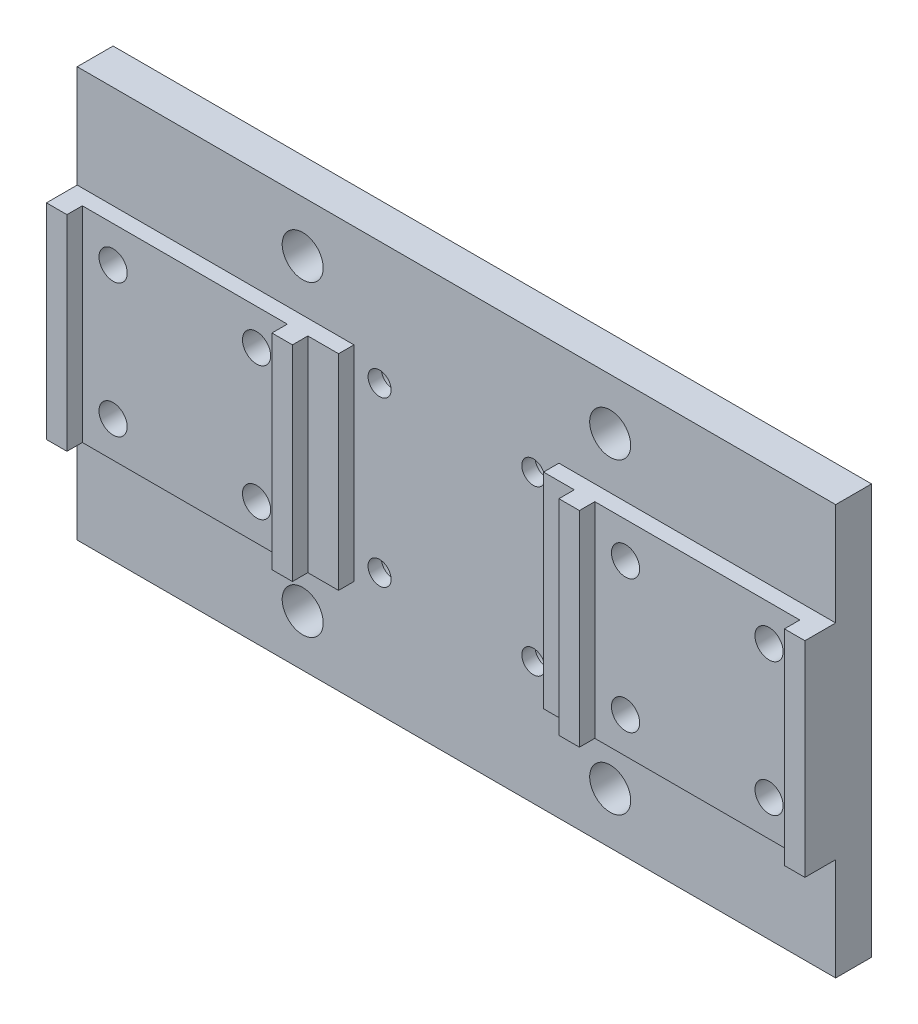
ISO-10303-21;
HEADER;
FILE_DESCRIPTION(('STEP AP214'),'2;1');
FILE_NAME('part.step','',(''),(''),'','','');
FILE_SCHEMA(('AUTOMOTIVE_DESIGN { 1 0 10303 214 1 1 1 1 }'));
ENDSEC;
DATA;
#1=APPLICATION_CONTEXT('core data for automotive mechanical design processes');
#2=APPLICATION_PROTOCOL_DEFINITION('international standard','automotive_design',2000,#1);
#3=PRODUCT_CONTEXT('',#1,'mechanical');
#4=PRODUCT('Part','Part','',(#3));
#5=PRODUCT_RELATED_PRODUCT_CATEGORY('part','',(#4));
#6=PRODUCT_DEFINITION_FORMATION('','',#4);
#7=PRODUCT_DEFINITION_CONTEXT('part definition',#1,'design');
#8=PRODUCT_DEFINITION('design','',#6,#7);
#9=PRODUCT_DEFINITION_SHAPE('','',#8);
#10=(LENGTH_UNIT() NAMED_UNIT(*) SI_UNIT(.MILLI.,.METRE.));
#11=(NAMED_UNIT(*) PLANE_ANGLE_UNIT() SI_UNIT($,.RADIAN.));
#12=(NAMED_UNIT(*) SI_UNIT($,.STERADIAN.) SOLID_ANGLE_UNIT());
#13=UNCERTAINTY_MEASURE_WITH_UNIT(LENGTH_MEASURE(1.E-05),#10,'distance_accuracy_value','');
#14=(GEOMETRIC_REPRESENTATION_CONTEXT(3) GLOBAL_UNCERTAINTY_ASSIGNED_CONTEXT((#13)) GLOBAL_UNIT_ASSIGNED_CONTEXT((#10,
#11,#12)) REPRESENTATION_CONTEXT('',''));
#15=CARTESIAN_POINT('',(0.,0.,0.));
#16=DIRECTION('',(0.,0.,1.));
#17=DIRECTION('',(1.,0.,0.));
#18=AXIS2_PLACEMENT_3D('',#15,#16,#17);
#19=CARTESIAN_POINT('',(0.,0.,7.));
#20=DIRECTION('',(0.,0.,-1.));
#21=DIRECTION('',(-1.,0.,0.));
#22=AXIS2_PLACEMENT_3D('',#19,#20,#21);
#23=PLANE('',#22);
#24=CARTESIAN_POINT('',(64.,-0.607626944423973,7.));
#25=DIRECTION('',(0.,0.,-1.));
#26=DIRECTION('',(-1.,0.,0.));
#27=AXIS2_PLACEMENT_3D('',#24,#25,#26);
#28=CIRCLE('',#27,2.75);
#29=CARTESIAN_POINT('',(61.25,-0.607626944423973,7.));
#30=VERTEX_POINT('',#29);
#31=EDGE_CURVE('E283',#30,#30,#28,.T.);
#32=ORIENTED_EDGE('',*,*,#31,.T.);
#33=EDGE_LOOP('',(#32));
#34=FACE_BOUND('',#33,.T.);
#35=CARTESIAN_POINT('',(36.,-0.60762694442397,7.));
#36=DIRECTION('',(0.,0.,-1.));
#37=DIRECTION('',(-1.,0.,0.));
#38=AXIS2_PLACEMENT_3D('',#35,#36,#37);
#39=CIRCLE('',#38,2.75);
#40=CARTESIAN_POINT('',(33.25,-0.60762694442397,7.));
#41=VERTEX_POINT('',#40);
#42=EDGE_CURVE('E360',#41,#41,#39,.T.);
#43=ORIENTED_EDGE('',*,*,#42,.T.);
#44=EDGE_LOOP('',(#43));
#45=FACE_BOUND('',#44,.T.);
#46=CARTESIAN_POINT('',(36.,-26.607626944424,7.));
#47=DIRECTION('',(0.,0.,-1.));
#48=DIRECTION('',(-1.,0.,0.));
#49=AXIS2_PLACEMENT_3D('',#46,#47,#48);
#50=CIRCLE('',#49,2.75);
#51=CARTESIAN_POINT('',(33.25,-26.607626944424,7.));
#52=VERTEX_POINT('',#51);
#53=EDGE_CURVE('E356',#52,#52,#50,.T.);
#54=ORIENTED_EDGE('',*,*,#53,.T.);
#55=EDGE_LOOP('',(#54));
#56=FACE_BOUND('',#55,.T.);
#57=CARTESIAN_POINT('',(64.,-26.607626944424,7.));
#58=DIRECTION('',(0.,0.,-1.));
#59=DIRECTION('',(-1.,0.,0.));
#60=AXIS2_PLACEMENT_3D('',#57,#58,#59);
#61=CIRCLE('',#60,2.75);
#62=CARTESIAN_POINT('',(61.25,-26.607626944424,7.));
#63=VERTEX_POINT('',#62);
#64=EDGE_CURVE('E351',#63,#63,#61,.T.);
#65=ORIENTED_EDGE('',*,*,#64,.T.);
#66=EDGE_LOOP('',(#65));
#67=FACE_BOUND('',#66,.T.);
#68=DIRECTION('',(0.,-1.,0.));
#69=VECTOR('',#68,1.);
#70=CARTESIAN_POINT('',(70.,6.39237305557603,7.));
#71=LINE('',#70,#69);
#72=CARTESIAN_POINT('',(70.,6.39237305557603,7.));
#73=VERTEX_POINT('',#72);
#74=CARTESIAN_POINT('',(70.,-33.607626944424,7.));
#75=VERTEX_POINT('',#74);
#76=EDGE_CURVE('E51',#73,#75,#71,.T.);
#77=ORIENTED_EDGE('',*,*,#76,.F.);
#78=DIRECTION('',(-1.,0.,0.));
#79=VECTOR('',#78,1.);
#80=CARTESIAN_POINT('',(74.,6.39237305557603,7.));
#81=LINE('',#80,#79);
#82=CARTESIAN_POINT('',(30.,6.39237305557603,7.));
#83=VERTEX_POINT('',#82);
#84=EDGE_CURVE('E37',#73,#83,#81,.T.);
#85=ORIENTED_EDGE('',*,*,#84,.T.);
#86=DIRECTION('',(0.,1.,0.));
#87=VECTOR('',#86,1.);
#88=CARTESIAN_POINT('',(30.,6.39237305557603,7.));
#89=LINE('',#88,#87);
#90=CARTESIAN_POINT('',(30.,-33.607626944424,7.));
#91=VERTEX_POINT('',#90);
#92=EDGE_CURVE('E247',#91,#83,#89,.T.);
#93=ORIENTED_EDGE('',*,*,#92,.F.);
#94=DIRECTION('',(1.,0.,0.));
#95=VECTOR('',#94,1.);
#96=CARTESIAN_POINT('',(74.,-33.607626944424,7.));
#97=LINE('',#96,#95);
#98=EDGE_CURVE('E56',#91,#75,#97,.T.);
#99=ORIENTED_EDGE('',*,*,#98,.T.);
#100=EDGE_LOOP('',(#77,#85,#93,#99));
#101=FACE_BOUND('',#100,.T.);
#102=ADVANCED_FACE('F33',(#34,#45,#56,#67,#101),#23,.F.);
#103=CARTESIAN_POINT('',(0.,0.,7.));
#104=DIRECTION('',(0.,0.,1.));
#105=DIRECTION('',(1.,0.,0.));
#106=AXIS2_PLACEMENT_3D('',#103,#104,#105);
#107=PLANE('',#106);
#108=CARTESIAN_POINT('',(-36.,-0.60762694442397,7.));
#109=DIRECTION('',(0.,0.,1.));
#110=DIRECTION('',(1.,0.,0.));
#111=AXIS2_PLACEMENT_3D('',#108,#109,#110);
#112=CIRCLE('',#111,2.75);
#113=CARTESIAN_POINT('',(-33.25,-0.60762694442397,7.));
#114=VERTEX_POINT('',#113);
#115=EDGE_CURVE('E346',#114,#114,#112,.T.);
#116=ORIENTED_EDGE('',*,*,#115,.F.);
#117=EDGE_LOOP('',(#116));
#118=FACE_BOUND('',#117,.T.);
#119=CARTESIAN_POINT('',(-64.,-0.607626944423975,7.));
#120=DIRECTION('',(0.,0.,1.));
#121=DIRECTION('',(1.,0.,0.));
#122=AXIS2_PLACEMENT_3D('',#119,#120,#121);
#123=CIRCLE('',#122,2.75);
#124=CARTESIAN_POINT('',(-61.25,-0.607626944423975,7.));
#125=VERTEX_POINT('',#124);
#126=EDGE_CURVE('E341',#125,#125,#123,.T.);
#127=ORIENTED_EDGE('',*,*,#126,.F.);
#128=EDGE_LOOP('',(#127));
#129=FACE_BOUND('',#128,.T.);
#130=CARTESIAN_POINT('',(-64.,-26.607626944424,7.));
#131=DIRECTION('',(0.,0.,1.));
#132=DIRECTION('',(1.,0.,0.));
#133=AXIS2_PLACEMENT_3D('',#130,#131,#132);
#134=CIRCLE('',#133,2.75);
#135=CARTESIAN_POINT('',(-61.25,-26.607626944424,7.));
#136=VERTEX_POINT('',#135);
#137=EDGE_CURVE('E336',#136,#136,#134,.T.);
#138=ORIENTED_EDGE('',*,*,#137,.F.);
#139=EDGE_LOOP('',(#138));
#140=FACE_BOUND('',#139,.T.);
#141=CARTESIAN_POINT('',(-36.,-26.607626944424,7.));
#142=DIRECTION('',(0.,0.,1.));
#143=DIRECTION('',(1.,0.,0.));
#144=AXIS2_PLACEMENT_3D('',#141,#142,#143);
#145=CIRCLE('',#144,2.75);
#146=CARTESIAN_POINT('',(-33.25,-26.607626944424,7.));
#147=VERTEX_POINT('',#146);
#148=EDGE_CURVE('E331',#147,#147,#145,.T.);
#149=ORIENTED_EDGE('',*,*,#148,.F.);
#150=EDGE_LOOP('',(#149));
#151=FACE_BOUND('',#150,.T.);
#152=DIRECTION('',(-1.,0.,0.));
#153=VECTOR('',#152,1.);
#154=CARTESIAN_POINT('',(-74.,6.39237305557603,7.));
#155=LINE('',#154,#153);
#156=CARTESIAN_POINT('',(-30.,6.39237305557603,7.));
#157=VERTEX_POINT('',#156);
#158=CARTESIAN_POINT('',(-70.,6.39237305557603,7.));
#159=VERTEX_POINT('',#158);
#160=EDGE_CURVE('E288',#157,#159,#155,.T.);
#161=ORIENTED_EDGE('',*,*,#160,.T.);
#162=DIRECTION('',(0.,1.,0.));
#163=VECTOR('',#162,1.);
#164=CARTESIAN_POINT('',(-70.,6.39237305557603,7.));
#165=LINE('',#164,#163);
#166=CARTESIAN_POINT('',(-70.,-33.607626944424,7.));
#167=VERTEX_POINT('',#166);
#168=EDGE_CURVE('E217',#167,#159,#165,.T.);
#169=ORIENTED_EDGE('',*,*,#168,.F.);
#170=DIRECTION('',(1.,0.,0.));
#171=VECTOR('',#170,1.);
#172=CARTESIAN_POINT('',(-74.,-33.607626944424,7.));
#173=LINE('',#172,#171);
#174=CARTESIAN_POINT('',(-30.,-33.607626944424,7.));
#175=VERTEX_POINT('',#174);
#176=EDGE_CURVE('E268',#167,#175,#173,.T.);
#177=ORIENTED_EDGE('',*,*,#176,.T.);
#178=DIRECTION('',(0.,-1.,0.));
#179=VECTOR('',#178,1.);
#180=CARTESIAN_POINT('',(-30.,6.39237305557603,7.));
#181=LINE('',#180,#179);
#182=EDGE_CURVE('E653',#157,#175,#181,.T.);
#183=ORIENTED_EDGE('',*,*,#182,.F.);
#184=EDGE_LOOP('',(#161,#169,#177,#183));
#185=FACE_BOUND('',#184,.T.);
#186=ADVANCED_FACE('F719',(#118,#129,#140,#151,#185),#107,.T.);
#187=DIRECTION('',(0.,-1.,0.));
#188=VECTOR('',#187,1.);
#189=CARTESIAN_POINT('',(26.,6.39237305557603,7.));
#190=LINE('',#189,#188);
#191=CARTESIAN_POINT('',(26.,6.39237305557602,7.));
#192=VERTEX_POINT('',#191);
#193=CARTESIAN_POINT('',(26.,-33.607626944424,7.));
#194=VERTEX_POINT('',#193);
#195=EDGE_CURVE('E242',#192,#194,#190,.T.);
#196=ORIENTED_EDGE('',*,*,#195,.F.);
#197=CARTESIAN_POINT('',(20.,6.39237305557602,7.));
#198=VERTEX_POINT('',#197);
#199=EDGE_CURVE('E463',#192,#198,#81,.T.);
#200=ORIENTED_EDGE('',*,*,#199,.T.);
#201=DIRECTION('',(0.,-1.,0.));
#202=VECTOR('',#201,1.);
#203=CARTESIAN_POINT('',(20.,6.39237305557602,7.));
#204=LINE('',#203,#202);
#205=CARTESIAN_POINT('',(20.,-33.607626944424,7.));
#206=VERTEX_POINT('',#205);
#207=EDGE_CURVE('E459',#198,#206,#204,.T.);
#208=ORIENTED_EDGE('',*,*,#207,.T.);
#209=EDGE_CURVE('E469',#206,#194,#97,.T.);
#210=ORIENTED_EDGE('',*,*,#209,.T.);
#211=EDGE_LOOP('',(#196,#200,#208,#210));
#212=FACE_BOUND('',#211,.T.);
#213=ADVANCED_FACE('F581',(#212),#23,.F.);
#214=CARTESIAN_POINT('',(-74.,-53.607626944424,4.));
#215=DIRECTION('',(0.,0.,1.));
#216=DIRECTION('',(1.,0.,0.));
#217=AXIS2_PLACEMENT_3D('',#214,#215,#216);
#218=PLANE('',#217);
#219=CARTESIAN_POINT('',(30.,-43.607626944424,4.));
#220=DIRECTION('',(0.,0.,1.));
#221=DIRECTION('',(1.,0.,0.));
#222=AXIS2_PLACEMENT_3D('',#219,#220,#221);
#223=CIRCLE('',#222,4.00000000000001);
#224=CARTESIAN_POINT('',(34.,-43.607626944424,4.));
#225=VERTEX_POINT('',#224);
#226=EDGE_CURVE('E563',#225,#225,#223,.T.);
#227=ORIENTED_EDGE('',*,*,#226,.F.);
#228=EDGE_LOOP('',(#227));
#229=FACE_BOUND('',#228,.T.);
#230=CARTESIAN_POINT('',(-30.,-43.607626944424,4.));
#231=DIRECTION('',(0.,0.,1.));
#232=DIRECTION('',(1.,0.,0.));
#233=AXIS2_PLACEMENT_3D('',#230,#231,#232);
#234=CIRCLE('',#233,4.);
#235=CARTESIAN_POINT('',(-26.,-43.607626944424,4.));
#236=VERTEX_POINT('',#235);
#237=EDGE_CURVE('E557',#236,#236,#234,.T.);
#238=ORIENTED_EDGE('',*,*,#237,.F.);
#239=EDGE_LOOP('',(#238));
#240=FACE_BOUND('',#239,.T.);
#241=CARTESIAN_POINT('',(30.,16.392373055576,4.));
#242=DIRECTION('',(0.,0.,1.));
#243=DIRECTION('',(1.,0.,0.));
#244=AXIS2_PLACEMENT_3D('',#241,#242,#243);
#245=CIRCLE('',#244,4.);
#246=CARTESIAN_POINT('',(34.,16.392373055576,4.));
#247=VERTEX_POINT('',#246);
#248=EDGE_CURVE('E551',#247,#247,#245,.T.);
#249=ORIENTED_EDGE('',*,*,#248,.F.);
#250=EDGE_LOOP('',(#249));
#251=FACE_BOUND('',#250,.T.);
#252=CARTESIAN_POINT('',(-30.,16.392373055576,4.));
#253=DIRECTION('',(0.,0.,1.));
#254=DIRECTION('',(1.,0.,0.));
#255=AXIS2_PLACEMENT_3D('',#252,#253,#254);
#256=CIRCLE('',#255,4.);
#257=CARTESIAN_POINT('',(-26.,16.392373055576,4.));
#258=VERTEX_POINT('',#257);
#259=EDGE_CURVE('E543',#258,#258,#256,.T.);
#260=ORIENTED_EDGE('',*,*,#259,.F.);
#261=EDGE_LOOP('',(#260));
#262=FACE_BOUND('',#261,.T.);
#263=CARTESIAN_POINT('',(15.,2.39237305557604,4.));
#264=DIRECTION('',(0.,0.,1.));
#265=DIRECTION('',(1.,0.,0.));
#266=AXIS2_PLACEMENT_3D('',#263,#264,#265);
#267=CIRCLE('',#266,2.25);
#268=CARTESIAN_POINT('',(17.25,2.39237305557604,4.));
#269=VERTEX_POINT('',#268);
#270=EDGE_CURVE('E326',#269,#269,#267,.T.);
#271=ORIENTED_EDGE('',*,*,#270,.F.);
#272=EDGE_LOOP('',(#271));
#273=FACE_BOUND('',#272,.T.);
#274=CARTESIAN_POINT('',(-15.,2.39237305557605,4.));
#275=DIRECTION('',(0.,0.,1.));
#276=DIRECTION('',(1.,0.,0.));
#277=AXIS2_PLACEMENT_3D('',#274,#275,#276);
#278=CIRCLE('',#277,2.25);
#279=CARTESIAN_POINT('',(-12.75,2.39237305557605,4.));
#280=VERTEX_POINT('',#279);
#281=EDGE_CURVE('E321',#280,#280,#278,.T.);
#282=ORIENTED_EDGE('',*,*,#281,.F.);
#283=EDGE_LOOP('',(#282));
#284=FACE_BOUND('',#283,.T.);
#285=CARTESIAN_POINT('',(-15.,-29.607626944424,4.));
#286=DIRECTION('',(0.,0.,1.));
#287=DIRECTION('',(1.,0.,0.));
#288=AXIS2_PLACEMENT_3D('',#285,#286,#287);
#289=CIRCLE('',#288,2.25);
#290=CARTESIAN_POINT('',(-12.75,-29.607626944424,4.));
#291=VERTEX_POINT('',#290);
#292=EDGE_CURVE('E316',#291,#291,#289,.T.);
#293=ORIENTED_EDGE('',*,*,#292,.F.);
#294=EDGE_LOOP('',(#293));
#295=FACE_BOUND('',#294,.T.);
#296=CARTESIAN_POINT('',(15.,-29.607626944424,4.));
#297=DIRECTION('',(0.,0.,1.));
#298=DIRECTION('',(1.,0.,0.));
#299=AXIS2_PLACEMENT_3D('',#296,#297,#298);
#300=CIRCLE('',#299,2.25);
#301=CARTESIAN_POINT('',(17.25,-29.607626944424,4.));
#302=VERTEX_POINT('',#301);
#303=EDGE_CURVE('E311',#302,#302,#300,.T.);
#304=ORIENTED_EDGE('',*,*,#303,.F.);
#305=EDGE_LOOP('',(#304));
#306=FACE_BOUND('',#305,.T.);
#307=DIRECTION('',(0.,-1.,0.));
#308=VECTOR('',#307,1.);
#309=CARTESIAN_POINT('',(20.,6.39237305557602,4.));
#310=LINE('',#309,#308);
#311=CARTESIAN_POINT('',(20.,6.39237305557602,4.));
#312=VERTEX_POINT('',#311);
#313=CARTESIAN_POINT('',(20.,-33.607626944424,4.));
#314=VERTEX_POINT('',#313);
#315=EDGE_CURVE('E477',#312,#314,#310,.T.);
#316=ORIENTED_EDGE('',*,*,#315,.F.);
#317=DIRECTION('',(-1.,0.,0.));
#318=VECTOR('',#317,1.);
#319=CARTESIAN_POINT('',(74.,6.39237305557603,4.));
#320=LINE('',#319,#318);
#321=CARTESIAN_POINT('',(74.,6.39237305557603,4.));
#322=VERTEX_POINT('',#321);
#323=EDGE_CURVE('E456',#322,#312,#320,.T.);
#324=ORIENTED_EDGE('',*,*,#323,.F.);
#325=DIRECTION('',(0.,1.,0.));
#326=VECTOR('',#325,1.);
#327=CARTESIAN_POINT('',(74.,26.392373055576,4.));
#328=LINE('',#327,#326);
#329=CARTESIAN_POINT('',(74.,26.392373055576,4.));
#330=VERTEX_POINT('',#329);
#331=EDGE_CURVE('E523',#322,#330,#328,.T.);
#332=ORIENTED_EDGE('',*,*,#331,.T.);
#333=DIRECTION('',(-1.,0.,0.));
#334=VECTOR('',#333,1.);
#335=CARTESIAN_POINT('',(-74.,26.392373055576,4.));
#336=LINE('',#335,#334);
#337=CARTESIAN_POINT('',(-74.,26.392373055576,4.));
#338=VERTEX_POINT('',#337);
#339=EDGE_CURVE('E521',#330,#338,#336,.T.);
#340=ORIENTED_EDGE('',*,*,#339,.T.);
#341=DIRECTION('',(0.,-1.,0.));
#342=VECTOR('',#341,1.);
#343=CARTESIAN_POINT('',(-74.,26.392373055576,4.));
#344=LINE('',#343,#342);
#345=CARTESIAN_POINT('',(-74.,6.39237305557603,4.));
#346=VERTEX_POINT('',#345);
#347=EDGE_CURVE('E506',#338,#346,#344,.T.);
#348=ORIENTED_EDGE('',*,*,#347,.T.);
#349=DIRECTION('',(-1.,0.,0.));
#350=VECTOR('',#349,1.);
#351=CARTESIAN_POINT('',(-74.,6.39237305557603,4.));
#352=LINE('',#351,#350);
#353=CARTESIAN_POINT('',(-20.,6.39237305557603,4.));
#354=VERTEX_POINT('',#353);
#355=EDGE_CURVE('E282',#354,#346,#352,.T.);
#356=ORIENTED_EDGE('',*,*,#355,.F.);
#357=DIRECTION('',(0.,1.,0.));
#358=VECTOR('',#357,1.);
#359=CARTESIAN_POINT('',(-20.,6.39237305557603,4.));
#360=LINE('',#359,#358);
#361=CARTESIAN_POINT('',(-20.,-33.607626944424,4.));
#362=VERTEX_POINT('',#361);
#363=EDGE_CURVE('E292',#362,#354,#360,.T.);
#364=ORIENTED_EDGE('',*,*,#363,.F.);
#365=DIRECTION('',(1.,0.,0.));
#366=VECTOR('',#365,1.);
#367=CARTESIAN_POINT('',(-74.,-33.607626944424,4.));
#368=LINE('',#367,#366);
#369=CARTESIAN_POINT('',(-74.,-33.607626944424,4.));
#370=VERTEX_POINT('',#369);
#371=EDGE_CURVE('E296',#370,#362,#368,.T.);
#372=ORIENTED_EDGE('',*,*,#371,.F.);
#373=CARTESIAN_POINT('',(-74.,-53.607626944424,4.));
#374=VERTEX_POINT('',#373);
#375=EDGE_CURVE('E499',#370,#374,#344,.T.);
#376=ORIENTED_EDGE('',*,*,#375,.T.);
#377=DIRECTION('',(1.,0.,0.));
#378=VECTOR('',#377,1.);
#379=CARTESIAN_POINT('',(-74.,-53.607626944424,4.));
#380=LINE('',#379,#378);
#381=CARTESIAN_POINT('',(74.,-53.607626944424,4.));
#382=VERTEX_POINT('',#381);
#383=EDGE_CURVE('E512',#374,#382,#380,.T.);
#384=ORIENTED_EDGE('',*,*,#383,.T.);
#385=CARTESIAN_POINT('',(74.,-33.607626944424,4.));
#386=VERTEX_POINT('',#385);
#387=EDGE_CURVE('E522',#382,#386,#328,.T.);
#388=ORIENTED_EDGE('',*,*,#387,.T.);
#389=DIRECTION('',(1.,0.,0.));
#390=VECTOR('',#389,1.);
#391=CARTESIAN_POINT('',(74.,-33.607626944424,4.));
#392=LINE('',#391,#390);
#393=EDGE_CURVE('E466',#314,#386,#392,.T.);
#394=ORIENTED_EDGE('',*,*,#393,.F.);
#395=EDGE_LOOP('',(#316,#324,#332,#340,#348,#356,#364,#372,#376,#384,#388,#394));
#396=FACE_BOUND('',#395,.T.);
#397=ADVANCED_FACE('F530',(#229,#240,#251,#262,#273,#284,#295,#306,#396),#218,.T.);
#398=CARTESIAN_POINT('',(-74.,26.392373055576,4.));
#399=DIRECTION('',(1.,0.,0.));
#400=DIRECTION('',(0.,0.,-1.));
#401=AXIS2_PLACEMENT_3D('',#398,#399,#400);
#402=PLANE('',#401);
#403=DIRECTION('',(0.,0.,-1.));
#404=VECTOR('',#403,1.);
#405=CARTESIAN_POINT('',(-74.,26.392373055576,4.));
#406=LINE('',#405,#404);
#407=CARTESIAN_POINT('',(-74.,26.392373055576,-3.));
#408=VERTEX_POINT('',#407);
#409=EDGE_CURVE('E519',#338,#408,#406,.T.);
#410=ORIENTED_EDGE('',*,*,#409,.T.);
#411=DIRECTION('',(0.,1.,0.));
#412=VECTOR('',#411,1.);
#413=CARTESIAN_POINT('',(-74.,26.392373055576,-3.));
#414=LINE('',#413,#412);
#415=CARTESIAN_POINT('',(-74.,-53.607626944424,-3.));
#416=VERTEX_POINT('',#415);
#417=EDGE_CURVE('E451',#416,#408,#414,.T.);
#418=ORIENTED_EDGE('',*,*,#417,.F.);
#419=DIRECTION('',(0.,0.,-1.));
#420=VECTOR('',#419,1.);
#421=CARTESIAN_POINT('',(-74.,-53.607626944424,4.));
#422=LINE('',#421,#420);
#423=EDGE_CURVE('E11',#374,#416,#422,.T.);
#424=ORIENTED_EDGE('',*,*,#423,.F.);
#425=ORIENTED_EDGE('',*,*,#375,.F.);
#426=DIRECTION('',(0.,0.,-1.));
#427=VECTOR('',#426,1.);
#428=CARTESIAN_POINT('',(-74.,-33.607626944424,7.));
#429=LINE('',#428,#427);
#430=CARTESIAN_POINT('',(-74.,-33.607626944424,10.));
#431=VERTEX_POINT('',#430);
#432=EDGE_CURVE('E503',#431,#370,#429,.T.);
#433=ORIENTED_EDGE('',*,*,#432,.F.);
#434=DIRECTION('',(0.,-1.,0.));
#435=VECTOR('',#434,1.);
#436=CARTESIAN_POINT('',(-74.,6.39237305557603,10.));
#437=LINE('',#436,#435);
#438=CARTESIAN_POINT('',(-74.,6.39237305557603,10.));
#439=VERTEX_POINT('',#438);
#440=EDGE_CURVE('E231',#439,#431,#437,.T.);
#441=ORIENTED_EDGE('',*,*,#440,.F.);
#442=DIRECTION('',(0.,0.,-1.));
#443=VECTOR('',#442,1.);
#444=CARTESIAN_POINT('',(-74.,6.39237305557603,7.));
#445=LINE('',#444,#443);
#446=EDGE_CURVE('E287',#439,#346,#445,.T.);
#447=ORIENTED_EDGE('',*,*,#446,.T.);
#448=ORIENTED_EDGE('',*,*,#347,.F.);
#449=EDGE_LOOP('',(#410,#418,#424,#425,#433,#441,#447,#448));
#450=FACE_BOUND('',#449,.T.);
#451=ADVANCED_FACE('F35',(#450),#402,.F.);
#452=CARTESIAN_POINT('',(-74.,-53.607626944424,4.));
#453=DIRECTION('',(0.,1.,0.));
#454=DIRECTION('',(-1.,0.,0.));
#455=AXIS2_PLACEMENT_3D('',#452,#453,#454);
#456=PLANE('',#455);
#457=ORIENTED_EDGE('',*,*,#423,.T.);
#458=DIRECTION('',(-1.,0.,0.));
#459=VECTOR('',#458,1.);
#460=CARTESIAN_POINT('',(74.,-53.607626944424,-3.));
#461=LINE('',#460,#459);
#462=CARTESIAN_POINT('',(74.,-53.607626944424,-3.));
#463=VERTEX_POINT('',#462);
#464=EDGE_CURVE('E448',#463,#416,#461,.T.);
#465=ORIENTED_EDGE('',*,*,#464,.F.);
#466=DIRECTION('',(0.,0.,-1.));
#467=VECTOR('',#466,1.);
#468=CARTESIAN_POINT('',(74.,-53.607626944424,4.));
#469=LINE('',#468,#467);
#470=EDGE_CURVE('E43',#382,#463,#469,.T.);
#471=ORIENTED_EDGE('',*,*,#470,.F.);
#472=ORIENTED_EDGE('',*,*,#383,.F.);
#473=EDGE_LOOP('',(#457,#465,#471,#472));
#474=FACE_BOUND('',#473,.T.);
#475=ADVANCED_FACE('F535',(#474),#456,.F.);
#476=CARTESIAN_POINT('',(74.,26.392373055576,4.));
#477=DIRECTION('',(-1.,0.,0.));
#478=DIRECTION('',(0.,0.,1.));
#479=AXIS2_PLACEMENT_3D('',#476,#477,#478);
#480=PLANE('',#479);
#481=ORIENTED_EDGE('',*,*,#470,.T.);
#482=DIRECTION('',(0.,-1.,0.));
#483=VECTOR('',#482,1.);
#484=CARTESIAN_POINT('',(74.,26.392373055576,-3.));
#485=LINE('',#484,#483);
#486=CARTESIAN_POINT('',(74.,26.392373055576,-3.));
#487=VERTEX_POINT('',#486);
#488=EDGE_CURVE('E314',#487,#463,#485,.T.);
#489=ORIENTED_EDGE('',*,*,#488,.F.);
#490=DIRECTION('',(0.,0.,-1.));
#491=VECTOR('',#490,1.);
#492=CARTESIAN_POINT('',(74.,26.392373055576,4.));
#493=LINE('',#492,#491);
#494=EDGE_CURVE('E517',#330,#487,#493,.T.);
#495=ORIENTED_EDGE('',*,*,#494,.F.);
#496=ORIENTED_EDGE('',*,*,#331,.F.);
#497=DIRECTION('',(0.,0.,-1.));
#498=VECTOR('',#497,1.);
#499=CARTESIAN_POINT('',(74.,6.39237305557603,7.));
#500=LINE('',#499,#498);
#501=CARTESIAN_POINT('',(74.,6.39237305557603,10.));
#502=VERTEX_POINT('',#501);
#503=EDGE_CURVE('E275',#502,#322,#500,.T.);
#504=ORIENTED_EDGE('',*,*,#503,.F.);
#505=DIRECTION('',(0.,1.,0.));
#506=VECTOR('',#505,1.);
#507=CARTESIAN_POINT('',(74.,6.39237305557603,10.));
#508=LINE('',#507,#506);
#509=CARTESIAN_POINT('',(74.,-33.607626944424,10.));
#510=VERTEX_POINT('',#509);
#511=EDGE_CURVE('E205',#510,#502,#508,.T.);
#512=ORIENTED_EDGE('',*,*,#511,.F.);
#513=DIRECTION('',(0.,0.,-1.));
#514=VECTOR('',#513,1.);
#515=CARTESIAN_POINT('',(74.,-33.607626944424,7.));
#516=LINE('',#515,#514);
#517=EDGE_CURVE('E201',#510,#386,#516,.T.);
#518=ORIENTED_EDGE('',*,*,#517,.T.);
#519=ORIENTED_EDGE('',*,*,#387,.F.);
#520=EDGE_LOOP('',(#481,#489,#495,#496,#504,#512,#518,#519));
#521=FACE_BOUND('',#520,.T.);
#522=ADVANCED_FACE('F538',(#521),#480,.F.);
#523=CARTESIAN_POINT('',(-74.,26.392373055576,4.));
#524=DIRECTION('',(0.,-1.,0.));
#525=DIRECTION('',(1.,0.,0.));
#526=AXIS2_PLACEMENT_3D('',#523,#524,#525);
#527=PLANE('',#526);
#528=ORIENTED_EDGE('',*,*,#494,.T.);
#529=DIRECTION('',(1.,0.,0.));
#530=VECTOR('',#529,1.);
#531=CARTESIAN_POINT('',(74.,26.392373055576,-3.));
#532=LINE('',#531,#530);
#533=EDGE_CURVE('E454',#408,#487,#532,.T.);
#534=ORIENTED_EDGE('',*,*,#533,.F.);
#535=ORIENTED_EDGE('',*,*,#409,.F.);
#536=ORIENTED_EDGE('',*,*,#339,.F.);
#537=EDGE_LOOP('',(#528,#534,#535,#536));
#538=FACE_BOUND('',#537,.T.);
#539=ADVANCED_FACE('F624',(#538),#527,.F.);
#540=DIRECTION('',(0.,1.,0.));
#541=VECTOR('',#540,1.);
#542=CARTESIAN_POINT('',(-26.,6.39237305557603,7.));
#543=LINE('',#542,#541);
#544=CARTESIAN_POINT('',(-26.,-33.607626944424,7.));
#545=VERTEX_POINT('',#544);
#546=CARTESIAN_POINT('',(-26.,6.39237305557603,7.));
#547=VERTEX_POINT('',#546);
#548=EDGE_CURVE('E666',#545,#547,#543,.T.);
#549=ORIENTED_EDGE('',*,*,#548,.F.);
#550=CARTESIAN_POINT('',(-20.,-33.607626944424,7.));
#551=VERTEX_POINT('',#550);
#552=EDGE_CURVE('E271',#545,#551,#173,.T.);
#553=ORIENTED_EDGE('',*,*,#552,.T.);
#554=DIRECTION('',(0.,1.,0.));
#555=VECTOR('',#554,1.);
#556=CARTESIAN_POINT('',(-20.,6.39237305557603,7.));
#557=LINE('',#556,#555);
#558=CARTESIAN_POINT('',(-20.,6.39237305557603,7.));
#559=VERTEX_POINT('',#558);
#560=EDGE_CURVE('E270',#551,#559,#557,.T.);
#561=ORIENTED_EDGE('',*,*,#560,.T.);
#562=EDGE_CURVE('E285',#559,#547,#155,.T.);
#563=ORIENTED_EDGE('',*,*,#562,.T.);
#564=EDGE_LOOP('',(#549,#553,#561,#563));
#565=FACE_BOUND('',#564,.T.);
#566=ADVANCED_FACE('F726',(#565),#107,.T.);
#567=CARTESIAN_POINT('',(-74.,6.39237305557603,7.));
#568=DIRECTION('',(0.,-1.,0.));
#569=DIRECTION('',(0.,0.,-1.));
#570=AXIS2_PLACEMENT_3D('',#567,#568,#569);
#571=PLANE('',#570);
#572=ORIENTED_EDGE('',*,*,#355,.T.);
#573=ORIENTED_EDGE('',*,*,#446,.F.);
#574=DIRECTION('',(-1.,0.,0.));
#575=VECTOR('',#574,1.);
#576=CARTESIAN_POINT('',(-70.,6.39237305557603,10.));
#577=LINE('',#576,#575);
#578=CARTESIAN_POINT('',(-70.,6.39237305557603,10.));
#579=VERTEX_POINT('',#578);
#580=EDGE_CURVE('E228',#579,#439,#577,.T.);
#581=ORIENTED_EDGE('',*,*,#580,.F.);
#582=DIRECTION('',(0.,0.,-1.));
#583=VECTOR('',#582,1.);
#584=CARTESIAN_POINT('',(-70.,6.39237305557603,10.));
#585=LINE('',#584,#583);
#586=EDGE_CURVE('E239',#579,#159,#585,.T.);
#587=ORIENTED_EDGE('',*,*,#586,.T.);
#588=ORIENTED_EDGE('',*,*,#160,.F.);
#589=DIRECTION('',(0.,0.,-1.));
#590=VECTOR('',#589,1.);
#591=CARTESIAN_POINT('',(-30.,6.39237305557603,10.));
#592=LINE('',#591,#590);
#593=CARTESIAN_POINT('',(-30.,6.39237305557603,10.));
#594=VERTEX_POINT('',#593);
#595=EDGE_CURVE('E646',#594,#157,#592,.T.);
#596=ORIENTED_EDGE('',*,*,#595,.F.);
#597=DIRECTION('',(-1.,0.,0.));
#598=VECTOR('',#597,1.);
#599=CARTESIAN_POINT('',(-30.,6.39237305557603,10.));
#600=LINE('',#599,#598);
#601=CARTESIAN_POINT('',(-26.,6.39237305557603,10.));
#602=VERTEX_POINT('',#601);
#603=EDGE_CURVE('E657',#602,#594,#600,.T.);
#604=ORIENTED_EDGE('',*,*,#603,.F.);
#605=DIRECTION('',(0.,0.,-1.));
#606=VECTOR('',#605,1.);
#607=CARTESIAN_POINT('',(-26.,6.39237305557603,10.));
#608=LINE('',#607,#606);
#609=EDGE_CURVE('E656',#602,#547,#608,.T.);
#610=ORIENTED_EDGE('',*,*,#609,.T.);
#611=ORIENTED_EDGE('',*,*,#562,.F.);
#612=DIRECTION('',(0.,0.,-1.));
#613=VECTOR('',#612,1.);
#614=CARTESIAN_POINT('',(-20.,6.39237305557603,7.));
#615=LINE('',#614,#613);
#616=EDGE_CURVE('E299',#559,#354,#615,.T.);
#617=ORIENTED_EDGE('',*,*,#616,.T.);
#618=EDGE_LOOP('',(#572,#573,#581,#587,#588,#596,#604,#610,#611,#617));
#619=FACE_BOUND('',#618,.T.);
#620=ADVANCED_FACE('F628',(#619),#571,.F.);
#621=CARTESIAN_POINT('',(-20.,6.39237305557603,7.));
#622=DIRECTION('',(-1.,0.,0.));
#623=DIRECTION('',(0.,-1.,0.));
#624=AXIS2_PLACEMENT_3D('',#621,#622,#623);
#625=PLANE('',#624);
#626=ORIENTED_EDGE('',*,*,#363,.T.);
#627=ORIENTED_EDGE('',*,*,#616,.F.);
#628=ORIENTED_EDGE('',*,*,#560,.F.);
#629=DIRECTION('',(0.,0.,-1.));
#630=VECTOR('',#629,1.);
#631=CARTESIAN_POINT('',(-20.,-33.607626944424,7.));
#632=LINE('',#631,#630);
#633=EDGE_CURVE('E504',#551,#362,#632,.T.);
#634=ORIENTED_EDGE('',*,*,#633,.T.);
#635=EDGE_LOOP('',(#626,#627,#628,#634));
#636=FACE_BOUND('',#635,.T.);
#637=ADVANCED_FACE('F1273',(#636),#625,.F.);
#638=CARTESIAN_POINT('',(-74.,-33.607626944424,7.));
#639=DIRECTION('',(0.,1.,0.));
#640=DIRECTION('',(0.,0.,1.));
#641=AXIS2_PLACEMENT_3D('',#638,#639,#640);
#642=PLANE('',#641);
#643=ORIENTED_EDGE('',*,*,#371,.T.);
#644=ORIENTED_EDGE('',*,*,#633,.F.);
#645=ORIENTED_EDGE('',*,*,#552,.F.);
#646=DIRECTION('',(0.,0.,-1.));
#647=VECTOR('',#646,1.);
#648=CARTESIAN_POINT('',(-26.,-33.607626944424,10.));
#649=LINE('',#648,#647);
#650=CARTESIAN_POINT('',(-26.,-33.607626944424,10.));
#651=VERTEX_POINT('',#650);
#652=EDGE_CURVE('E659',#651,#545,#649,.T.);
#653=ORIENTED_EDGE('',*,*,#652,.F.);
#654=DIRECTION('',(1.,0.,0.));
#655=VECTOR('',#654,1.);
#656=CARTESIAN_POINT('',(-30.,-33.607626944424,10.));
#657=LINE('',#656,#655);
#658=CARTESIAN_POINT('',(-30.,-33.607626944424,10.));
#659=VERTEX_POINT('',#658);
#660=EDGE_CURVE('E1397',#659,#651,#657,.T.);
#661=ORIENTED_EDGE('',*,*,#660,.F.);
#662=DIRECTION('',(0.,0.,-1.));
#663=VECTOR('',#662,1.);
#664=CARTESIAN_POINT('',(-30.,-33.607626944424,10.));
#665=LINE('',#664,#663);
#666=EDGE_CURVE('E683',#659,#175,#665,.T.);
#667=ORIENTED_EDGE('',*,*,#666,.T.);
#668=ORIENTED_EDGE('',*,*,#176,.F.);
#669=DIRECTION('',(0.,0.,-1.));
#670=VECTOR('',#669,1.);
#671=CARTESIAN_POINT('',(-70.,-33.607626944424,10.));
#672=LINE('',#671,#670);
#673=CARTESIAN_POINT('',(-70.,-33.607626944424,10.));
#674=VERTEX_POINT('',#673);
#675=EDGE_CURVE('E235',#674,#167,#672,.T.);
#676=ORIENTED_EDGE('',*,*,#675,.F.);
#677=DIRECTION('',(1.,0.,0.));
#678=VECTOR('',#677,1.);
#679=CARTESIAN_POINT('',(-70.,-33.607626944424,10.));
#680=LINE('',#679,#678);
#681=EDGE_CURVE('E234',#431,#674,#680,.T.);
#682=ORIENTED_EDGE('',*,*,#681,.F.);
#683=ORIENTED_EDGE('',*,*,#432,.T.);
#684=EDGE_LOOP('',(#643,#644,#645,#653,#661,#667,#668,#676,#682,#683));
#685=FACE_BOUND('',#684,.T.);
#686=ADVANCED_FACE('F635',(#685),#642,.F.);
#687=CARTESIAN_POINT('',(74.,6.39237305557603,7.));
#688=DIRECTION('',(0.,-1.,0.));
#689=DIRECTION('',(1.,0.,0.));
#690=AXIS2_PLACEMENT_3D('',#687,#688,#689);
#691=PLANE('',#690);
#692=ORIENTED_EDGE('',*,*,#323,.T.);
#693=DIRECTION('',(0.,0.,-1.));
#694=VECTOR('',#693,1.);
#695=CARTESIAN_POINT('',(20.,6.39237305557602,7.));
#696=LINE('',#695,#694);
#697=EDGE_CURVE('E484',#198,#312,#696,.T.);
#698=ORIENTED_EDGE('',*,*,#697,.F.);
#699=ORIENTED_EDGE('',*,*,#199,.F.);
#700=DIRECTION('',(0.,0.,-1.));
#701=VECTOR('',#700,1.);
#702=CARTESIAN_POINT('',(26.,6.39237305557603,10.));
#703=LINE('',#702,#701);
#704=CARTESIAN_POINT('',(26.,6.39237305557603,10.));
#705=VERTEX_POINT('',#704);
#706=EDGE_CURVE('E253',#705,#192,#703,.T.);
#707=ORIENTED_EDGE('',*,*,#706,.F.);
#708=DIRECTION('',(-1.,0.,0.));
#709=VECTOR('',#708,1.);
#710=CARTESIAN_POINT('',(26.,6.39237305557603,10.));
#711=LINE('',#710,#709);
#712=CARTESIAN_POINT('',(30.,6.39237305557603,10.));
#713=VERTEX_POINT('',#712);
#714=EDGE_CURVE('E251',#713,#705,#711,.T.);
#715=ORIENTED_EDGE('',*,*,#714,.F.);
#716=DIRECTION('',(0.,0.,-1.));
#717=VECTOR('',#716,1.);
#718=CARTESIAN_POINT('',(30.,6.39237305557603,10.));
#719=LINE('',#718,#717);
#720=EDGE_CURVE('E266',#713,#83,#719,.T.);
#721=ORIENTED_EDGE('',*,*,#720,.T.);
#722=ORIENTED_EDGE('',*,*,#84,.F.);
#723=DIRECTION('',(0.,0.,-1.));
#724=VECTOR('',#723,1.);
#725=CARTESIAN_POINT('',(70.,6.39237305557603,10.));
#726=LINE('',#725,#724);
#727=CARTESIAN_POINT('',(70.,6.39237305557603,10.));
#728=VERTEX_POINT('',#727);
#729=EDGE_CURVE('E218',#728,#73,#726,.T.);
#730=ORIENTED_EDGE('',*,*,#729,.F.);
#731=DIRECTION('',(-1.,0.,0.));
#732=VECTOR('',#731,1.);
#733=CARTESIAN_POINT('',(70.,6.39237305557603,10.));
#734=LINE('',#733,#732);
#735=EDGE_CURVE('E211',#502,#728,#734,.T.);
#736=ORIENTED_EDGE('',*,*,#735,.F.);
#737=ORIENTED_EDGE('',*,*,#503,.T.);
#738=EDGE_LOOP('',(#692,#698,#699,#707,#715,#721,#722,#730,#736,#737));
#739=FACE_BOUND('',#738,.T.);
#740=ADVANCED_FACE('F738',(#739),#691,.F.);
#741=CARTESIAN_POINT('',(20.,6.39237305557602,7.));
#742=DIRECTION('',(1.,0.,0.));
#743=DIRECTION('',(0.,0.,-1.));
#744=AXIS2_PLACEMENT_3D('',#741,#742,#743);
#745=PLANE('',#744);
#746=ORIENTED_EDGE('',*,*,#315,.T.);
#747=DIRECTION('',(0.,0.,-1.));
#748=VECTOR('',#747,1.);
#749=CARTESIAN_POINT('',(20.,-33.607626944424,7.));
#750=LINE('',#749,#748);
#751=EDGE_CURVE('E482',#206,#314,#750,.T.);
#752=ORIENTED_EDGE('',*,*,#751,.F.);
#753=ORIENTED_EDGE('',*,*,#207,.F.);
#754=ORIENTED_EDGE('',*,*,#697,.T.);
#755=EDGE_LOOP('',(#746,#752,#753,#754));
#756=FACE_BOUND('',#755,.T.);
#757=ADVANCED_FACE('F1303',(#756),#745,.F.);
#758=CARTESIAN_POINT('',(74.,-33.607626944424,7.));
#759=DIRECTION('',(0.,1.,0.));
#760=DIRECTION('',(-1.,0.,0.));
#761=AXIS2_PLACEMENT_3D('',#758,#759,#760);
#762=PLANE('',#761);
#763=ORIENTED_EDGE('',*,*,#393,.T.);
#764=ORIENTED_EDGE('',*,*,#517,.F.);
#765=DIRECTION('',(1.,0.,0.));
#766=VECTOR('',#765,1.);
#767=CARTESIAN_POINT('',(70.,-33.607626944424,10.));
#768=LINE('',#767,#766);
#769=CARTESIAN_POINT('',(70.,-33.607626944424,10.));
#770=VERTEX_POINT('',#769);
#771=EDGE_CURVE('E194',#770,#510,#768,.T.);
#772=ORIENTED_EDGE('',*,*,#771,.F.);
#773=DIRECTION('',(0.,0.,-1.));
#774=VECTOR('',#773,1.);
#775=CARTESIAN_POINT('',(70.,-33.607626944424,10.));
#776=LINE('',#775,#774);
#777=EDGE_CURVE('E199',#770,#75,#776,.T.);
#778=ORIENTED_EDGE('',*,*,#777,.T.);
#779=ORIENTED_EDGE('',*,*,#98,.F.);
#780=DIRECTION('',(0.,0.,-1.));
#781=VECTOR('',#780,1.);
#782=CARTESIAN_POINT('',(30.,-33.607626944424,10.));
#783=LINE('',#782,#781);
#784=CARTESIAN_POINT('',(30.,-33.607626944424,10.));
#785=VERTEX_POINT('',#784);
#786=EDGE_CURVE('E750',#785,#91,#783,.T.);
#787=ORIENTED_EDGE('',*,*,#786,.F.);
#788=DIRECTION('',(1.,0.,0.));
#789=VECTOR('',#788,1.);
#790=CARTESIAN_POINT('',(26.,-33.607626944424,10.));
#791=LINE('',#790,#789);
#792=CARTESIAN_POINT('',(26.,-33.607626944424,10.));
#793=VERTEX_POINT('',#792);
#794=EDGE_CURVE('E246',#793,#785,#791,.T.);
#795=ORIENTED_EDGE('',*,*,#794,.F.);
#796=DIRECTION('',(0.,0.,-1.));
#797=VECTOR('',#796,1.);
#798=CARTESIAN_POINT('',(26.,-33.607626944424,10.));
#799=LINE('',#798,#797);
#800=EDGE_CURVE('E667',#793,#194,#799,.T.);
#801=ORIENTED_EDGE('',*,*,#800,.T.);
#802=ORIENTED_EDGE('',*,*,#209,.F.);
#803=ORIENTED_EDGE('',*,*,#751,.T.);
#804=EDGE_LOOP('',(#763,#764,#772,#778,#779,#787,#795,#801,#802,#803));
#805=FACE_BOUND('',#804,.T.);
#806=ADVANCED_FACE('F197',(#805),#762,.F.);
#807=CARTESIAN_POINT('',(0.,0.,-3.));
#808=DIRECTION('',(0.,0.,-1.));
#809=DIRECTION('',(-1.,0.,0.));
#810=AXIS2_PLACEMENT_3D('',#807,#808,#809);
#811=PLANE('',#810);
#812=CARTESIAN_POINT('',(30.,-43.607626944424,-3.));
#813=DIRECTION('',(0.,0.,1.));
#814=DIRECTION('',(1.,0.,0.));
#815=AXIS2_PLACEMENT_3D('',#812,#813,#814);
#816=CIRCLE('',#815,4.00000000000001);
#817=CARTESIAN_POINT('',(34.,-43.607626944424,-3.));
#818=VERTEX_POINT('',#817);
#819=EDGE_CURVE('E560',#818,#818,#816,.T.);
#820=ORIENTED_EDGE('',*,*,#819,.T.);
#821=EDGE_LOOP('',(#820));
#822=FACE_BOUND('',#821,.T.);
#823=CARTESIAN_POINT('',(-30.,-43.607626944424,-3.));
#824=DIRECTION('',(0.,0.,1.));
#825=DIRECTION('',(1.,0.,0.));
#826=AXIS2_PLACEMENT_3D('',#823,#824,#825);
#827=CIRCLE('',#826,4.);
#828=CARTESIAN_POINT('',(-26.,-43.607626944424,-3.));
#829=VERTEX_POINT('',#828);
#830=EDGE_CURVE('E554',#829,#829,#827,.T.);
#831=ORIENTED_EDGE('',*,*,#830,.T.);
#832=EDGE_LOOP('',(#831));
#833=FACE_BOUND('',#832,.T.);
#834=CARTESIAN_POINT('',(30.,16.392373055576,-3.));
#835=DIRECTION('',(0.,0.,1.));
#836=DIRECTION('',(1.,0.,0.));
#837=AXIS2_PLACEMENT_3D('',#834,#835,#836);
#838=CIRCLE('',#837,4.);
#839=CARTESIAN_POINT('',(34.,16.392373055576,-3.));
#840=VERTEX_POINT('',#839);
#841=EDGE_CURVE('E548',#840,#840,#838,.T.);
#842=ORIENTED_EDGE('',*,*,#841,.T.);
#843=EDGE_LOOP('',(#842));
#844=FACE_BOUND('',#843,.T.);
#845=CARTESIAN_POINT('',(-30.,16.392373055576,-3.));
#846=DIRECTION('',(0.,0.,1.));
#847=DIRECTION('',(1.,0.,0.));
#848=AXIS2_PLACEMENT_3D('',#845,#846,#847);
#849=CIRCLE('',#848,4.);
#850=CARTESIAN_POINT('',(-26.,16.392373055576,-3.));
#851=VERTEX_POINT('',#850);
#852=EDGE_CURVE('E541',#851,#851,#849,.T.);
#853=ORIENTED_EDGE('',*,*,#852,.T.);
#854=EDGE_LOOP('',(#853));
#855=FACE_BOUND('',#854,.T.);
#856=CARTESIAN_POINT('',(64.,-0.607626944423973,-3.));
#857=DIRECTION('',(0.,0.,-1.));
#858=DIRECTION('',(-1.,0.,0.));
#859=AXIS2_PLACEMENT_3D('',#856,#857,#858);
#860=CIRCLE('',#859,5.);
#861=CARTESIAN_POINT('',(59.,-0.607626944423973,-3.));
#862=VERTEX_POINT('',#861);
#863=EDGE_CURVE('E675',#862,#862,#860,.T.);
#864=ORIENTED_EDGE('',*,*,#863,.F.);
#865=EDGE_LOOP('',(#864));
#866=FACE_BOUND('',#865,.T.);
#867=CARTESIAN_POINT('',(36.,-0.60762694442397,-3.));
#868=DIRECTION('',(0.,0.,-1.));
#869=DIRECTION('',(-1.,0.,0.));
#870=AXIS2_PLACEMENT_3D('',#867,#868,#869);
#871=CIRCLE('',#870,5.);
#872=CARTESIAN_POINT('',(31.,-0.60762694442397,-3.));
#873=VERTEX_POINT('',#872);
#874=EDGE_CURVE('E375',#873,#873,#871,.T.);
#875=ORIENTED_EDGE('',*,*,#874,.F.);
#876=EDGE_LOOP('',(#875));
#877=FACE_BOUND('',#876,.T.);
#878=CARTESIAN_POINT('',(36.,-26.607626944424,-3.));
#879=DIRECTION('',(0.,0.,-1.));
#880=DIRECTION('',(-1.,0.,0.));
#881=AXIS2_PLACEMENT_3D('',#878,#879,#880);
#882=CIRCLE('',#881,5.);
#883=CARTESIAN_POINT('',(31.,-26.607626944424,-3.));
#884=VERTEX_POINT('',#883);
#885=EDGE_CURVE('E362',#884,#884,#882,.T.);
#886=ORIENTED_EDGE('',*,*,#885,.F.);
#887=EDGE_LOOP('',(#886));
#888=FACE_BOUND('',#887,.T.);
#889=CARTESIAN_POINT('',(64.,-26.607626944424,-3.));
#890=DIRECTION('',(0.,0.,-1.));
#891=DIRECTION('',(-1.,0.,0.));
#892=AXIS2_PLACEMENT_3D('',#889,#890,#891);
#893=CIRCLE('',#892,5.);
#894=CARTESIAN_POINT('',(59.,-26.607626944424,-3.));
#895=VERTEX_POINT('',#894);
#896=EDGE_CURVE('E358',#895,#895,#893,.T.);
#897=ORIENTED_EDGE('',*,*,#896,.F.);
#898=EDGE_LOOP('',(#897));
#899=FACE_BOUND('',#898,.T.);
#900=CARTESIAN_POINT('',(-36.,-0.60762694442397,-3.));
#901=DIRECTION('',(0.,0.,-1.));
#902=DIRECTION('',(-1.,0.,0.));
#903=AXIS2_PLACEMENT_3D('',#900,#901,#902);
#904=CIRCLE('',#903,5.);
#905=CARTESIAN_POINT('',(-41.,-0.60762694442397,-3.));
#906=VERTEX_POINT('',#905);
#907=EDGE_CURVE('E354',#906,#906,#904,.T.);
#908=ORIENTED_EDGE('',*,*,#907,.F.);
#909=EDGE_LOOP('',(#908));
#910=FACE_BOUND('',#909,.T.);
#911=CARTESIAN_POINT('',(-64.,-0.607626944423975,-3.));
#912=DIRECTION('',(0.,0.,-1.));
#913=DIRECTION('',(-1.,0.,0.));
#914=AXIS2_PLACEMENT_3D('',#911,#912,#913);
#915=CIRCLE('',#914,5.);
#916=CARTESIAN_POINT('',(-69.,-0.607626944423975,-3.));
#917=VERTEX_POINT('',#916);
#918=EDGE_CURVE('E349',#917,#917,#915,.T.);
#919=ORIENTED_EDGE('',*,*,#918,.F.);
#920=EDGE_LOOP('',(#919));
#921=FACE_BOUND('',#920,.T.);
#922=CARTESIAN_POINT('',(-64.,-26.607626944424,-3.));
#923=DIRECTION('',(0.,0.,-1.));
#924=DIRECTION('',(-1.,0.,0.));
#925=AXIS2_PLACEMENT_3D('',#922,#923,#924);
#926=CIRCLE('',#925,5.);
#927=CARTESIAN_POINT('',(-69.,-26.607626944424,-3.));
#928=VERTEX_POINT('',#927);
#929=EDGE_CURVE('E344',#928,#928,#926,.T.);
#930=ORIENTED_EDGE('',*,*,#929,.F.);
#931=EDGE_LOOP('',(#930));
#932=FACE_BOUND('',#931,.T.);
#933=CARTESIAN_POINT('',(-36.,-26.607626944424,-3.));
#934=DIRECTION('',(0.,0.,-1.));
#935=DIRECTION('',(-1.,0.,0.));
#936=AXIS2_PLACEMENT_3D('',#933,#934,#935);
#937=CIRCLE('',#936,5.);
#938=CARTESIAN_POINT('',(-41.,-26.607626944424,-3.));
#939=VERTEX_POINT('',#938);
#940=EDGE_CURVE('E339',#939,#939,#937,.T.);
#941=ORIENTED_EDGE('',*,*,#940,.F.);
#942=EDGE_LOOP('',(#941));
#943=FACE_BOUND('',#942,.T.);
#944=CARTESIAN_POINT('',(15.,2.39237305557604,-3.));
#945=DIRECTION('',(0.,0.,-1.));
#946=DIRECTION('',(-1.,0.,0.));
#947=AXIS2_PLACEMENT_3D('',#944,#945,#946);
#948=CIRCLE('',#947,4.);
#949=CARTESIAN_POINT('',(11.,2.39237305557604,-3.));
#950=VERTEX_POINT('',#949);
#951=EDGE_CURVE('E334',#950,#950,#948,.T.);
#952=ORIENTED_EDGE('',*,*,#951,.F.);
#953=EDGE_LOOP('',(#952));
#954=FACE_BOUND('',#953,.T.);
#955=CARTESIAN_POINT('',(-15.,2.39237305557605,-3.));
#956=DIRECTION('',(0.,0.,-1.));
#957=DIRECTION('',(-1.,0.,0.));
#958=AXIS2_PLACEMENT_3D('',#955,#956,#957);
#959=CIRCLE('',#958,4.);
#960=CARTESIAN_POINT('',(-19.,2.39237305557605,-3.));
#961=VERTEX_POINT('',#960);
#962=EDGE_CURVE('E329',#961,#961,#959,.T.);
#963=ORIENTED_EDGE('',*,*,#962,.F.);
#964=EDGE_LOOP('',(#963));
#965=FACE_BOUND('',#964,.T.);
#966=CARTESIAN_POINT('',(-15.,-29.607626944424,-3.));
#967=DIRECTION('',(0.,0.,-1.));
#968=DIRECTION('',(-1.,0.,0.));
#969=AXIS2_PLACEMENT_3D('',#966,#967,#968);
#970=CIRCLE('',#969,4.);
#971=CARTESIAN_POINT('',(-19.,-29.607626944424,-3.));
#972=VERTEX_POINT('',#971);
#973=EDGE_CURVE('E324',#972,#972,#970,.T.);
#974=ORIENTED_EDGE('',*,*,#973,.F.);
#975=EDGE_LOOP('',(#974));
#976=FACE_BOUND('',#975,.T.);
#977=CARTESIAN_POINT('',(15.,-29.607626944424,-3.));
#978=DIRECTION('',(0.,0.,-1.));
#979=DIRECTION('',(-1.,0.,0.));
#980=AXIS2_PLACEMENT_3D('',#977,#978,#979);
#981=CIRCLE('',#980,4.);
#982=CARTESIAN_POINT('',(11.,-29.607626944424,-3.));
#983=VERTEX_POINT('',#982);
#984=EDGE_CURVE('E319',#983,#983,#981,.T.);
#985=ORIENTED_EDGE('',*,*,#984,.F.);
#986=EDGE_LOOP('',(#985));
#987=FACE_BOUND('',#986,.T.);
#988=ORIENTED_EDGE('',*,*,#488,.T.);
#989=ORIENTED_EDGE('',*,*,#464,.T.);
#990=ORIENTED_EDGE('',*,*,#417,.T.);
#991=ORIENTED_EDGE('',*,*,#533,.T.);
#992=EDGE_LOOP('',(#988,#989,#990,#991));
#993=FACE_BOUND('',#992,.T.);
#994=ADVANCED_FACE('F569',(#822,#833,#844,#855,#866,#877,#888,#899,#910,#921,#932,#943,#954,
#965,#976,#987,#993),#811,.T.);
#995=CARTESIAN_POINT('',(15.,-29.607626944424,-3.));
#996=DIRECTION('',(0.,0.,-1.));
#997=DIRECTION('',(-1.,0.,0.));
#998=AXIS2_PLACEMENT_3D('',#995,#996,#997);
#999=CYLINDRICAL_SURFACE('',#998,2.25);
#1000=ORIENTED_EDGE('',*,*,#303,.T.);
#1001=EDGE_LOOP('',(#1000));
#1002=FACE_BOUND('',#1001,.T.);
#1003=CARTESIAN_POINT('',(15.,-29.607626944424,1.4));
#1004=DIRECTION('',(0.,0.,-1.));
#1005=DIRECTION('',(-1.,0.,0.));
#1006=AXIS2_PLACEMENT_3D('',#1003,#1004,#1005);
#1007=CIRCLE('',#1006,2.25);
#1008=CARTESIAN_POINT('',(12.75,-29.607626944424,1.4));
#1009=VERTEX_POINT('',#1008);
#1010=EDGE_CURVE('E315',#1009,#1009,#1007,.T.);
#1011=ORIENTED_EDGE('',*,*,#1010,.T.);
#1012=EDGE_LOOP('',(#1011));
#1013=FACE_BOUND('',#1012,.T.);
#1014=ADVANCED_FACE('F597',(#1002,#1013),#999,.F.);
#1015=CARTESIAN_POINT('',(17.25,-29.607626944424,1.4));
#1016=DIRECTION('',(0.,0.,1.));
#1017=DIRECTION('',(1.,0.,0.));
#1018=AXIS2_PLACEMENT_3D('',#1015,#1016,#1017);
#1019=PLANE('',#1018);
#1020=ORIENTED_EDGE('',*,*,#1010,.F.);
#1021=EDGE_LOOP('',(#1020));
#1022=FACE_BOUND('',#1021,.T.);
#1023=CARTESIAN_POINT('',(15.,-29.607626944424,1.4));
#1024=DIRECTION('',(0.,0.,-1.));
#1025=DIRECTION('',(-1.,0.,0.));
#1026=AXIS2_PLACEMENT_3D('',#1023,#1024,#1025);
#1027=CIRCLE('',#1026,4.);
#1028=CARTESIAN_POINT('',(11.,-29.607626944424,1.4));
#1029=VERTEX_POINT('',#1028);
#1030=EDGE_CURVE('E441',#1029,#1029,#1027,.T.);
#1031=ORIENTED_EDGE('',*,*,#1030,.T.);
#1032=EDGE_LOOP('',(#1031));
#1033=FACE_BOUND('',#1032,.T.);
#1034=ADVANCED_FACE('F600',(#1022,#1033),#1019,.F.);
#1035=CARTESIAN_POINT('',(15.,-29.607626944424,-3.));
#1036=DIRECTION('',(0.,0.,-1.));
#1037=DIRECTION('',(-1.,0.,0.));
#1038=AXIS2_PLACEMENT_3D('',#1035,#1036,#1037);
#1039=CYLINDRICAL_SURFACE('',#1038,4.);
#1040=ORIENTED_EDGE('',*,*,#1030,.F.);
#1041=EDGE_LOOP('',(#1040));
#1042=FACE_BOUND('',#1041,.T.);
#1043=ORIENTED_EDGE('',*,*,#984,.T.);
#1044=EDGE_LOOP('',(#1043));
#1045=FACE_BOUND('',#1044,.T.);
#1046=ADVANCED_FACE('F606',(#1042,#1045),#1039,.F.);
#1047=CARTESIAN_POINT('',(-15.,-29.607626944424,-3.));
#1048=DIRECTION('',(0.,0.,-1.));
#1049=DIRECTION('',(-1.,0.,0.));
#1050=AXIS2_PLACEMENT_3D('',#1047,#1048,#1049);
#1051=CYLINDRICAL_SURFACE('',#1050,2.25);
#1052=ORIENTED_EDGE('',*,*,#292,.T.);
#1053=EDGE_LOOP('',(#1052));
#1054=FACE_BOUND('',#1053,.T.);
#1055=CARTESIAN_POINT('',(-15.,-29.607626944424,1.4));
#1056=DIRECTION('',(0.,0.,-1.));
#1057=DIRECTION('',(-1.,0.,0.));
#1058=AXIS2_PLACEMENT_3D('',#1055,#1056,#1057);
#1059=CIRCLE('',#1058,2.25);
#1060=CARTESIAN_POINT('',(-17.25,-29.607626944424,1.4));
#1061=VERTEX_POINT('',#1060);
#1062=EDGE_CURVE('E320',#1061,#1061,#1059,.T.);
#1063=ORIENTED_EDGE('',*,*,#1062,.T.);
#1064=EDGE_LOOP('',(#1063));
#1065=FACE_BOUND('',#1064,.T.);
#1066=ADVANCED_FACE('F612',(#1054,#1065),#1051,.F.);
#1067=CARTESIAN_POINT('',(-12.75,-29.607626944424,1.4));
#1068=DIRECTION('',(0.,0.,1.));
#1069=DIRECTION('',(1.,0.,0.));
#1070=AXIS2_PLACEMENT_3D('',#1067,#1068,#1069);
#1071=PLANE('',#1070);
#1072=ORIENTED_EDGE('',*,*,#1062,.F.);
#1073=EDGE_LOOP('',(#1072));
#1074=FACE_BOUND('',#1073,.T.);
#1075=CARTESIAN_POINT('',(-15.,-29.607626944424,1.4));
#1076=DIRECTION('',(0.,0.,-1.));
#1077=DIRECTION('',(-1.,0.,0.));
#1078=AXIS2_PLACEMENT_3D('',#1075,#1076,#1077);
#1079=CIRCLE('',#1078,4.);
#1080=CARTESIAN_POINT('',(-19.,-29.607626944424,1.4));
#1081=VERTEX_POINT('',#1080);
#1082=EDGE_CURVE('E434',#1081,#1081,#1079,.T.);
#1083=ORIENTED_EDGE('',*,*,#1082,.T.);
#1084=EDGE_LOOP('',(#1083));
#1085=FACE_BOUND('',#1084,.T.);
#1086=ADVANCED_FACE('F928',(#1074,#1085),#1071,.F.);
#1087=CARTESIAN_POINT('',(-15.,-29.607626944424,-3.));
#1088=DIRECTION('',(0.,0.,-1.));
#1089=DIRECTION('',(-1.,0.,0.));
#1090=AXIS2_PLACEMENT_3D('',#1087,#1088,#1089);
#1091=CYLINDRICAL_SURFACE('',#1090,4.);
#1092=ORIENTED_EDGE('',*,*,#1082,.F.);
#1093=EDGE_LOOP('',(#1092));
#1094=FACE_BOUND('',#1093,.T.);
#1095=ORIENTED_EDGE('',*,*,#973,.T.);
#1096=EDGE_LOOP('',(#1095));
#1097=FACE_BOUND('',#1096,.T.);
#1098=ADVANCED_FACE('F925',(#1094,#1097),#1091,.F.);
#1099=CARTESIAN_POINT('',(-15.,2.39237305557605,-3.));
#1100=DIRECTION('',(0.,0.,-1.));
#1101=DIRECTION('',(-1.,0.,0.));
#1102=AXIS2_PLACEMENT_3D('',#1099,#1100,#1101);
#1103=CYLINDRICAL_SURFACE('',#1102,2.25);
#1104=ORIENTED_EDGE('',*,*,#281,.T.);
#1105=EDGE_LOOP('',(#1104));
#1106=FACE_BOUND('',#1105,.T.);
#1107=CARTESIAN_POINT('',(-15.,2.39237305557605,1.4));
#1108=DIRECTION('',(0.,0.,-1.));
#1109=DIRECTION('',(-1.,0.,0.));
#1110=AXIS2_PLACEMENT_3D('',#1107,#1108,#1109);
#1111=CIRCLE('',#1110,2.25);
#1112=CARTESIAN_POINT('',(-17.25,2.39237305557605,1.4));
#1113=VERTEX_POINT('',#1112);
#1114=EDGE_CURVE('E325',#1113,#1113,#1111,.T.);
#1115=ORIENTED_EDGE('',*,*,#1114,.T.);
#1116=EDGE_LOOP('',(#1115));
#1117=FACE_BOUND('',#1116,.T.);
#1118=ADVANCED_FACE('F927',(#1106,#1117),#1103,.F.);
#1119=CARTESIAN_POINT('',(-12.75,2.39237305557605,1.4));
#1120=DIRECTION('',(0.,0.,1.));
#1121=DIRECTION('',(1.,0.,0.));
#1122=AXIS2_PLACEMENT_3D('',#1119,#1120,#1121);
#1123=PLANE('',#1122);
#1124=ORIENTED_EDGE('',*,*,#1114,.F.);
#1125=EDGE_LOOP('',(#1124));
#1126=FACE_BOUND('',#1125,.T.);
#1127=CARTESIAN_POINT('',(-15.,2.39237305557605,1.4));
#1128=DIRECTION('',(0.,0.,-1.));
#1129=DIRECTION('',(-1.,0.,0.));
#1130=AXIS2_PLACEMENT_3D('',#1127,#1128,#1129);
#1131=CIRCLE('',#1130,4.);
#1132=CARTESIAN_POINT('',(-19.,2.39237305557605,1.4));
#1133=VERTEX_POINT('',#1132);
#1134=EDGE_CURVE('E427',#1133,#1133,#1131,.T.);
#1135=ORIENTED_EDGE('',*,*,#1134,.T.);
#1136=EDGE_LOOP('',(#1135));
#1137=FACE_BOUND('',#1136,.T.);
#1138=ADVANCED_FACE('F935',(#1126,#1137),#1123,.F.);
#1139=CARTESIAN_POINT('',(-15.,2.39237305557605,-3.));
#1140=DIRECTION('',(0.,0.,-1.));
#1141=DIRECTION('',(-1.,0.,0.));
#1142=AXIS2_PLACEMENT_3D('',#1139,#1140,#1141);
#1143=CYLINDRICAL_SURFACE('',#1142,4.);
#1144=ORIENTED_EDGE('',*,*,#1134,.F.);
#1145=EDGE_LOOP('',(#1144));
#1146=FACE_BOUND('',#1145,.T.);
#1147=ORIENTED_EDGE('',*,*,#962,.T.);
#1148=EDGE_LOOP('',(#1147));
#1149=FACE_BOUND('',#1148,.T.);
#1150=ADVANCED_FACE('F975',(#1146,#1149),#1143,.F.);
#1151=CARTESIAN_POINT('',(15.,2.39237305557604,-3.));
#1152=DIRECTION('',(0.,0.,-1.));
#1153=DIRECTION('',(-1.,0.,0.));
#1154=AXIS2_PLACEMENT_3D('',#1151,#1152,#1153);
#1155=CYLINDRICAL_SURFACE('',#1154,2.25);
#1156=ORIENTED_EDGE('',*,*,#270,.T.);
#1157=EDGE_LOOP('',(#1156));
#1158=FACE_BOUND('',#1157,.T.);
#1159=CARTESIAN_POINT('',(15.,2.39237305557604,1.4));
#1160=DIRECTION('',(0.,0.,-1.));
#1161=DIRECTION('',(-1.,0.,0.));
#1162=AXIS2_PLACEMENT_3D('',#1159,#1160,#1161);
#1163=CIRCLE('',#1162,2.25);
#1164=CARTESIAN_POINT('',(12.75,2.39237305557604,1.4));
#1165=VERTEX_POINT('',#1164);
#1166=EDGE_CURVE('E330',#1165,#1165,#1163,.T.);
#1167=ORIENTED_EDGE('',*,*,#1166,.T.);
#1168=EDGE_LOOP('',(#1167));
#1169=FACE_BOUND('',#1168,.T.);
#1170=ADVANCED_FACE('F984',(#1158,#1169),#1155,.F.);
#1171=CARTESIAN_POINT('',(17.25,2.39237305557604,1.4));
#1172=DIRECTION('',(0.,0.,1.));
#1173=DIRECTION('',(1.,0.,0.));
#1174=AXIS2_PLACEMENT_3D('',#1171,#1172,#1173);
#1175=PLANE('',#1174);
#1176=ORIENTED_EDGE('',*,*,#1166,.F.);
#1177=EDGE_LOOP('',(#1176));
#1178=FACE_BOUND('',#1177,.T.);
#1179=CARTESIAN_POINT('',(15.,2.39237305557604,1.4));
#1180=DIRECTION('',(0.,0.,-1.));
#1181=DIRECTION('',(-1.,0.,0.));
#1182=AXIS2_PLACEMENT_3D('',#1179,#1180,#1181);
#1183=CIRCLE('',#1182,4.);
#1184=CARTESIAN_POINT('',(11.,2.39237305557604,1.4));
#1185=VERTEX_POINT('',#1184);
#1186=EDGE_CURVE('E420',#1185,#1185,#1183,.T.);
#1187=ORIENTED_EDGE('',*,*,#1186,.T.);
#1188=EDGE_LOOP('',(#1187));
#1189=FACE_BOUND('',#1188,.T.);
#1190=ADVANCED_FACE('F994',(#1178,#1189),#1175,.F.);
#1191=CARTESIAN_POINT('',(15.,2.39237305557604,-3.));
#1192=DIRECTION('',(0.,0.,-1.));
#1193=DIRECTION('',(-1.,0.,0.));
#1194=AXIS2_PLACEMENT_3D('',#1191,#1192,#1193);
#1195=CYLINDRICAL_SURFACE('',#1194,4.);
#1196=ORIENTED_EDGE('',*,*,#1186,.F.);
#1197=EDGE_LOOP('',(#1196));
#1198=FACE_BOUND('',#1197,.T.);
#1199=ORIENTED_EDGE('',*,*,#951,.T.);
#1200=EDGE_LOOP('',(#1199));
#1201=FACE_BOUND('',#1200,.T.);
#1202=ADVANCED_FACE('F1004',(#1198,#1201),#1195,.F.);
#1203=CARTESIAN_POINT('',(-36.,-26.607626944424,-3.));
#1204=DIRECTION('',(0.,0.,-1.));
#1205=DIRECTION('',(-1.,0.,0.));
#1206=AXIS2_PLACEMENT_3D('',#1203,#1204,#1205);
#1207=CYLINDRICAL_SURFACE('',#1206,2.75);
#1208=ORIENTED_EDGE('',*,*,#148,.T.);
#1209=EDGE_LOOP('',(#1208));
#1210=FACE_BOUND('',#1209,.T.);
#1211=CARTESIAN_POINT('',(-36.,-26.607626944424,2.4));
#1212=DIRECTION('',(0.,0.,-1.));
#1213=DIRECTION('',(-1.,0.,0.));
#1214=AXIS2_PLACEMENT_3D('',#1211,#1212,#1213);
#1215=CIRCLE('',#1214,2.75);
#1216=CARTESIAN_POINT('',(-38.75,-26.607626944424,2.4));
#1217=VERTEX_POINT('',#1216);
#1218=EDGE_CURVE('E335',#1217,#1217,#1215,.T.);
#1219=ORIENTED_EDGE('',*,*,#1218,.T.);
#1220=EDGE_LOOP('',(#1219));
#1221=FACE_BOUND('',#1220,.T.);
#1222=ADVANCED_FACE('F1014',(#1210,#1221),#1207,.F.);
#1223=CARTESIAN_POINT('',(-33.25,-26.607626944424,2.4));
#1224=DIRECTION('',(0.,0.,1.));
#1225=DIRECTION('',(1.,0.,0.));
#1226=AXIS2_PLACEMENT_3D('',#1223,#1224,#1225);
#1227=PLANE('',#1226);
#1228=ORIENTED_EDGE('',*,*,#1218,.F.);
#1229=EDGE_LOOP('',(#1228));
#1230=FACE_BOUND('',#1229,.T.);
#1231=CARTESIAN_POINT('',(-36.,-26.607626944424,2.4));
#1232=DIRECTION('',(0.,0.,-1.));
#1233=DIRECTION('',(-1.,0.,0.));
#1234=AXIS2_PLACEMENT_3D('',#1231,#1232,#1233);
#1235=CIRCLE('',#1234,5.);
#1236=CARTESIAN_POINT('',(-41.,-26.607626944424,2.4));
#1237=VERTEX_POINT('',#1236);
#1238=EDGE_CURVE('E413',#1237,#1237,#1235,.T.);
#1239=ORIENTED_EDGE('',*,*,#1238,.T.);
#1240=EDGE_LOOP('',(#1239));
#1241=FACE_BOUND('',#1240,.T.);
#1242=ADVANCED_FACE('F1024',(#1230,#1241),#1227,.F.);
#1243=CARTESIAN_POINT('',(-36.,-26.607626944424,-3.));
#1244=DIRECTION('',(0.,0.,-1.));
#1245=DIRECTION('',(-1.,0.,0.));
#1246=AXIS2_PLACEMENT_3D('',#1243,#1244,#1245);
#1247=CYLINDRICAL_SURFACE('',#1246,5.);
#1248=ORIENTED_EDGE('',*,*,#1238,.F.);
#1249=EDGE_LOOP('',(#1248));
#1250=FACE_BOUND('',#1249,.T.);
#1251=ORIENTED_EDGE('',*,*,#940,.T.);
#1252=EDGE_LOOP('',(#1251));
#1253=FACE_BOUND('',#1252,.T.);
#1254=ADVANCED_FACE('F1034',(#1250,#1253),#1247,.F.);
#1255=CARTESIAN_POINT('',(-64.,-26.607626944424,-3.));
#1256=DIRECTION('',(0.,0.,-1.));
#1257=DIRECTION('',(-1.,0.,0.));
#1258=AXIS2_PLACEMENT_3D('',#1255,#1256,#1257);
#1259=CYLINDRICAL_SURFACE('',#1258,2.75);
#1260=ORIENTED_EDGE('',*,*,#137,.T.);
#1261=EDGE_LOOP('',(#1260));
#1262=FACE_BOUND('',#1261,.T.);
#1263=CARTESIAN_POINT('',(-64.,-26.607626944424,2.4));
#1264=DIRECTION('',(0.,0.,-1.));
#1265=DIRECTION('',(-1.,0.,0.));
#1266=AXIS2_PLACEMENT_3D('',#1263,#1264,#1265);
#1267=CIRCLE('',#1266,2.75);
#1268=CARTESIAN_POINT('',(-66.75,-26.607626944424,2.4));
#1269=VERTEX_POINT('',#1268);
#1270=EDGE_CURVE('E340',#1269,#1269,#1267,.T.);
#1271=ORIENTED_EDGE('',*,*,#1270,.T.);
#1272=EDGE_LOOP('',(#1271));
#1273=FACE_BOUND('',#1272,.T.);
#1274=ADVANCED_FACE('F1044',(#1262,#1273),#1259,.F.);
#1275=CARTESIAN_POINT('',(-61.25,-26.607626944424,2.4));
#1276=DIRECTION('',(0.,0.,1.));
#1277=DIRECTION('',(1.,0.,0.));
#1278=AXIS2_PLACEMENT_3D('',#1275,#1276,#1277);
#1279=PLANE('',#1278);
#1280=ORIENTED_EDGE('',*,*,#1270,.F.);
#1281=EDGE_LOOP('',(#1280));
#1282=FACE_BOUND('',#1281,.T.);
#1283=CARTESIAN_POINT('',(-64.,-26.607626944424,2.4));
#1284=DIRECTION('',(0.,0.,-1.));
#1285=DIRECTION('',(-1.,0.,0.));
#1286=AXIS2_PLACEMENT_3D('',#1283,#1284,#1285);
#1287=CIRCLE('',#1286,5.);
#1288=CARTESIAN_POINT('',(-69.,-26.607626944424,2.4));
#1289=VERTEX_POINT('',#1288);
#1290=EDGE_CURVE('E406',#1289,#1289,#1287,.T.);
#1291=ORIENTED_EDGE('',*,*,#1290,.T.);
#1292=EDGE_LOOP('',(#1291));
#1293=FACE_BOUND('',#1292,.T.);
#1294=ADVANCED_FACE('F1054',(#1282,#1293),#1279,.F.);
#1295=CARTESIAN_POINT('',(-64.,-26.607626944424,-3.));
#1296=DIRECTION('',(0.,0.,-1.));
#1297=DIRECTION('',(-1.,0.,0.));
#1298=AXIS2_PLACEMENT_3D('',#1295,#1296,#1297);
#1299=CYLINDRICAL_SURFACE('',#1298,5.);
#1300=ORIENTED_EDGE('',*,*,#1290,.F.);
#1301=EDGE_LOOP('',(#1300));
#1302=FACE_BOUND('',#1301,.T.);
#1303=ORIENTED_EDGE('',*,*,#929,.T.);
#1304=EDGE_LOOP('',(#1303));
#1305=FACE_BOUND('',#1304,.T.);
#1306=ADVANCED_FACE('F1064',(#1302,#1305),#1299,.F.);
#1307=CARTESIAN_POINT('',(-64.,-0.607626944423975,-3.));
#1308=DIRECTION('',(0.,0.,-1.));
#1309=DIRECTION('',(-1.,0.,0.));
#1310=AXIS2_PLACEMENT_3D('',#1307,#1308,#1309);
#1311=CYLINDRICAL_SURFACE('',#1310,2.75);
#1312=ORIENTED_EDGE('',*,*,#126,.T.);
#1313=EDGE_LOOP('',(#1312));
#1314=FACE_BOUND('',#1313,.T.);
#1315=CARTESIAN_POINT('',(-64.,-0.607626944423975,2.4));
#1316=DIRECTION('',(0.,0.,-1.));
#1317=DIRECTION('',(-1.,0.,0.));
#1318=AXIS2_PLACEMENT_3D('',#1315,#1316,#1317);
#1319=CIRCLE('',#1318,2.75);
#1320=CARTESIAN_POINT('',(-66.75,-0.607626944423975,2.4));
#1321=VERTEX_POINT('',#1320);
#1322=EDGE_CURVE('E345',#1321,#1321,#1319,.T.);
#1323=ORIENTED_EDGE('',*,*,#1322,.T.);
#1324=EDGE_LOOP('',(#1323));
#1325=FACE_BOUND('',#1324,.T.);
#1326=ADVANCED_FACE('F1074',(#1314,#1325),#1311,.F.);
#1327=CARTESIAN_POINT('',(-61.25,-0.607626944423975,2.4));
#1328=DIRECTION('',(0.,0.,1.));
#1329=DIRECTION('',(1.,0.,0.));
#1330=AXIS2_PLACEMENT_3D('',#1327,#1328,#1329);
#1331=PLANE('',#1330);
#1332=ORIENTED_EDGE('',*,*,#1322,.F.);
#1333=EDGE_LOOP('',(#1332));
#1334=FACE_BOUND('',#1333,.T.);
#1335=CARTESIAN_POINT('',(-64.,-0.607626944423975,2.4));
#1336=DIRECTION('',(0.,0.,-1.));
#1337=DIRECTION('',(-1.,0.,0.));
#1338=AXIS2_PLACEMENT_3D('',#1335,#1336,#1337);
#1339=CIRCLE('',#1338,5.);
#1340=CARTESIAN_POINT('',(-69.,-0.607626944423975,2.4));
#1341=VERTEX_POINT('',#1340);
#1342=EDGE_CURVE('E399',#1341,#1341,#1339,.T.);
#1343=ORIENTED_EDGE('',*,*,#1342,.T.);
#1344=EDGE_LOOP('',(#1343));
#1345=FACE_BOUND('',#1344,.T.);
#1346=ADVANCED_FACE('F1084',(#1334,#1345),#1331,.F.);
#1347=CARTESIAN_POINT('',(-64.,-0.607626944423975,-3.));
#1348=DIRECTION('',(0.,0.,-1.));
#1349=DIRECTION('',(-1.,0.,0.));
#1350=AXIS2_PLACEMENT_3D('',#1347,#1348,#1349);
#1351=CYLINDRICAL_SURFACE('',#1350,5.);
#1352=ORIENTED_EDGE('',*,*,#1342,.F.);
#1353=EDGE_LOOP('',(#1352));
#1354=FACE_BOUND('',#1353,.T.);
#1355=ORIENTED_EDGE('',*,*,#918,.T.);
#1356=EDGE_LOOP('',(#1355));
#1357=FACE_BOUND('',#1356,.T.);
#1358=ADVANCED_FACE('F1094',(#1354,#1357),#1351,.F.);
#1359=CARTESIAN_POINT('',(-36.,-0.60762694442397,-3.));
#1360=DIRECTION('',(0.,0.,-1.));
#1361=DIRECTION('',(-1.,0.,0.));
#1362=AXIS2_PLACEMENT_3D('',#1359,#1360,#1361);
#1363=CYLINDRICAL_SURFACE('',#1362,2.75);
#1364=ORIENTED_EDGE('',*,*,#115,.T.);
#1365=EDGE_LOOP('',(#1364));
#1366=FACE_BOUND('',#1365,.T.);
#1367=CARTESIAN_POINT('',(-36.,-0.60762694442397,2.4));
#1368=DIRECTION('',(0.,0.,-1.));
#1369=DIRECTION('',(-1.,0.,0.));
#1370=AXIS2_PLACEMENT_3D('',#1367,#1368,#1369);
#1371=CIRCLE('',#1370,2.75);
#1372=CARTESIAN_POINT('',(-38.75,-0.60762694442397,2.4));
#1373=VERTEX_POINT('',#1372);
#1374=EDGE_CURVE('E350',#1373,#1373,#1371,.T.);
#1375=ORIENTED_EDGE('',*,*,#1374,.T.);
#1376=EDGE_LOOP('',(#1375));
#1377=FACE_BOUND('',#1376,.T.);
#1378=ADVANCED_FACE('F1104',(#1366,#1377),#1363,.F.);
#1379=CARTESIAN_POINT('',(-33.25,-0.60762694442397,2.4));
#1380=DIRECTION('',(0.,0.,1.));
#1381=DIRECTION('',(1.,0.,0.));
#1382=AXIS2_PLACEMENT_3D('',#1379,#1380,#1381);
#1383=PLANE('',#1382);
#1384=ORIENTED_EDGE('',*,*,#1374,.F.);
#1385=EDGE_LOOP('',(#1384));
#1386=FACE_BOUND('',#1385,.T.);
#1387=CARTESIAN_POINT('',(-36.,-0.60762694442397,2.4));
#1388=DIRECTION('',(0.,0.,-1.));
#1389=DIRECTION('',(-1.,0.,0.));
#1390=AXIS2_PLACEMENT_3D('',#1387,#1388,#1389);
#1391=CIRCLE('',#1390,5.);
#1392=CARTESIAN_POINT('',(-41.,-0.60762694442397,2.4));
#1393=VERTEX_POINT('',#1392);
#1394=EDGE_CURVE('E392',#1393,#1393,#1391,.T.);
#1395=ORIENTED_EDGE('',*,*,#1394,.T.);
#1396=EDGE_LOOP('',(#1395));
#1397=FACE_BOUND('',#1396,.T.);
#1398=ADVANCED_FACE('F1114',(#1386,#1397),#1383,.F.);
#1399=CARTESIAN_POINT('',(-36.,-0.60762694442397,-3.));
#1400=DIRECTION('',(0.,0.,-1.));
#1401=DIRECTION('',(-1.,0.,0.));
#1402=AXIS2_PLACEMENT_3D('',#1399,#1400,#1401);
#1403=CYLINDRICAL_SURFACE('',#1402,5.);
#1404=ORIENTED_EDGE('',*,*,#1394,.F.);
#1405=EDGE_LOOP('',(#1404));
#1406=FACE_BOUND('',#1405,.T.);
#1407=ORIENTED_EDGE('',*,*,#907,.T.);
#1408=EDGE_LOOP('',(#1407));
#1409=FACE_BOUND('',#1408,.T.);
#1410=ADVANCED_FACE('F1124',(#1406,#1409),#1403,.F.);
#1411=CARTESIAN_POINT('',(64.,-26.607626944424,-3.));
#1412=DIRECTION('',(0.,0.,-1.));
#1413=DIRECTION('',(-1.,0.,0.));
#1414=AXIS2_PLACEMENT_3D('',#1411,#1412,#1413);
#1415=CYLINDRICAL_SURFACE('',#1414,2.75);
#1416=CARTESIAN_POINT('',(64.,-26.607626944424,2.4));
#1417=DIRECTION('',(0.,0.,-1.));
#1418=DIRECTION('',(-1.,0.,0.));
#1419=AXIS2_PLACEMENT_3D('',#1416,#1417,#1418);
#1420=CIRCLE('',#1419,2.75);
#1421=CARTESIAN_POINT('',(61.25,-26.607626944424,2.4));
#1422=VERTEX_POINT('',#1421);
#1423=EDGE_CURVE('E355',#1422,#1422,#1420,.T.);
#1424=ORIENTED_EDGE('',*,*,#1423,.T.);
#1425=EDGE_LOOP('',(#1424));
#1426=FACE_BOUND('',#1425,.T.);
#1427=ORIENTED_EDGE('',*,*,#64,.F.);
#1428=EDGE_LOOP('',(#1427));
#1429=FACE_BOUND('',#1428,.T.);
#1430=ADVANCED_FACE('F1134',(#1426,#1429),#1415,.F.);
#1431=CARTESIAN_POINT('',(66.75,-26.607626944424,2.4));
#1432=DIRECTION('',(0.,0.,1.));
#1433=DIRECTION('',(1.,0.,0.));
#1434=AXIS2_PLACEMENT_3D('',#1431,#1432,#1433);
#1435=PLANE('',#1434);
#1436=ORIENTED_EDGE('',*,*,#1423,.F.);
#1437=EDGE_LOOP('',(#1436));
#1438=FACE_BOUND('',#1437,.T.);
#1439=CARTESIAN_POINT('',(64.,-26.607626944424,2.4));
#1440=DIRECTION('',(0.,0.,-1.));
#1441=DIRECTION('',(-1.,0.,0.));
#1442=AXIS2_PLACEMENT_3D('',#1439,#1440,#1441);
#1443=CIRCLE('',#1442,5.);
#1444=CARTESIAN_POINT('',(59.,-26.607626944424,2.4));
#1445=VERTEX_POINT('',#1444);
#1446=EDGE_CURVE('E385',#1445,#1445,#1443,.T.);
#1447=ORIENTED_EDGE('',*,*,#1446,.T.);
#1448=EDGE_LOOP('',(#1447));
#1449=FACE_BOUND('',#1448,.T.);
#1450=ADVANCED_FACE('F1144',(#1438,#1449),#1435,.F.);
#1451=CARTESIAN_POINT('',(64.,-26.607626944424,-3.));
#1452=DIRECTION('',(0.,0.,-1.));
#1453=DIRECTION('',(-1.,0.,0.));
#1454=AXIS2_PLACEMENT_3D('',#1451,#1452,#1453);
#1455=CYLINDRICAL_SURFACE('',#1454,5.);
#1456=ORIENTED_EDGE('',*,*,#1446,.F.);
#1457=EDGE_LOOP('',(#1456));
#1458=FACE_BOUND('',#1457,.T.);
#1459=ORIENTED_EDGE('',*,*,#896,.T.);
#1460=EDGE_LOOP('',(#1459));
#1461=FACE_BOUND('',#1460,.T.);
#1462=ADVANCED_FACE('F1154',(#1458,#1461),#1455,.F.);
#1463=CARTESIAN_POINT('',(36.,-26.607626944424,-3.));
#1464=DIRECTION('',(0.,0.,-1.));
#1465=DIRECTION('',(-1.,0.,0.));
#1466=AXIS2_PLACEMENT_3D('',#1463,#1464,#1465);
#1467=CYLINDRICAL_SURFACE('',#1466,2.75);
#1468=CARTESIAN_POINT('',(36.,-26.607626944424,2.4));
#1469=DIRECTION('',(0.,0.,-1.));
#1470=DIRECTION('',(-1.,0.,0.));
#1471=AXIS2_PLACEMENT_3D('',#1468,#1469,#1470);
#1472=CIRCLE('',#1471,2.75);
#1473=CARTESIAN_POINT('',(33.25,-26.607626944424,2.4));
#1474=VERTEX_POINT('',#1473);
#1475=EDGE_CURVE('E359',#1474,#1474,#1472,.T.);
#1476=ORIENTED_EDGE('',*,*,#1475,.T.);
#1477=EDGE_LOOP('',(#1476));
#1478=FACE_BOUND('',#1477,.T.);
#1479=ORIENTED_EDGE('',*,*,#53,.F.);
#1480=EDGE_LOOP('',(#1479));
#1481=FACE_BOUND('',#1480,.T.);
#1482=ADVANCED_FACE('F1164',(#1478,#1481),#1467,.F.);
#1483=CARTESIAN_POINT('',(38.75,-26.607626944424,2.4));
#1484=DIRECTION('',(0.,0.,1.));
#1485=DIRECTION('',(1.,0.,0.));
#1486=AXIS2_PLACEMENT_3D('',#1483,#1484,#1485);
#1487=PLANE('',#1486);
#1488=ORIENTED_EDGE('',*,*,#1475,.F.);
#1489=EDGE_LOOP('',(#1488));
#1490=FACE_BOUND('',#1489,.T.);
#1491=CARTESIAN_POINT('',(36.,-26.607626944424,2.4));
#1492=DIRECTION('',(0.,0.,-1.));
#1493=DIRECTION('',(-1.,0.,0.));
#1494=AXIS2_PLACEMENT_3D('',#1491,#1492,#1493);
#1495=CIRCLE('',#1494,5.);
#1496=CARTESIAN_POINT('',(31.,-26.607626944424,2.4));
#1497=VERTEX_POINT('',#1496);
#1498=EDGE_CURVE('E367',#1497,#1497,#1495,.T.);
#1499=ORIENTED_EDGE('',*,*,#1498,.T.);
#1500=EDGE_LOOP('',(#1499));
#1501=FACE_BOUND('',#1500,.T.);
#1502=ADVANCED_FACE('F1174',(#1490,#1501),#1487,.F.);
#1503=CARTESIAN_POINT('',(36.,-26.607626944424,-3.));
#1504=DIRECTION('',(0.,0.,-1.));
#1505=DIRECTION('',(-1.,0.,0.));
#1506=AXIS2_PLACEMENT_3D('',#1503,#1504,#1505);
#1507=CYLINDRICAL_SURFACE('',#1506,5.);
#1508=ORIENTED_EDGE('',*,*,#1498,.F.);
#1509=EDGE_LOOP('',(#1508));
#1510=FACE_BOUND('',#1509,.T.);
#1511=ORIENTED_EDGE('',*,*,#885,.T.);
#1512=EDGE_LOOP('',(#1511));
#1513=FACE_BOUND('',#1512,.T.);
#1514=ADVANCED_FACE('F1184',(#1510,#1513),#1507,.F.);
#1515=CARTESIAN_POINT('',(36.,-0.60762694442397,-3.));
#1516=DIRECTION('',(0.,0.,-1.));
#1517=DIRECTION('',(-1.,0.,0.));
#1518=AXIS2_PLACEMENT_3D('',#1515,#1516,#1517);
#1519=CYLINDRICAL_SURFACE('',#1518,2.75);
#1520=CARTESIAN_POINT('',(36.,-0.60762694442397,2.4));
#1521=DIRECTION('',(0.,0.,-1.));
#1522=DIRECTION('',(-1.,0.,0.));
#1523=AXIS2_PLACEMENT_3D('',#1520,#1521,#1522);
#1524=CIRCLE('',#1523,2.75);
#1525=CARTESIAN_POINT('',(33.25,-0.60762694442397,2.4));
#1526=VERTEX_POINT('',#1525);
#1527=EDGE_CURVE('E363',#1526,#1526,#1524,.T.);
#1528=ORIENTED_EDGE('',*,*,#1527,.T.);
#1529=EDGE_LOOP('',(#1528));
#1530=FACE_BOUND('',#1529,.T.);
#1531=ORIENTED_EDGE('',*,*,#42,.F.);
#1532=EDGE_LOOP('',(#1531));
#1533=FACE_BOUND('',#1532,.T.);
#1534=ADVANCED_FACE('F1194',(#1530,#1533),#1519,.F.);
#1535=CARTESIAN_POINT('',(38.75,-0.60762694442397,2.4));
#1536=DIRECTION('',(0.,0.,1.));
#1537=DIRECTION('',(1.,0.,0.));
#1538=AXIS2_PLACEMENT_3D('',#1535,#1536,#1537);
#1539=PLANE('',#1538);
#1540=ORIENTED_EDGE('',*,*,#1527,.F.);
#1541=EDGE_LOOP('',(#1540));
#1542=FACE_BOUND('',#1541,.T.);
#1543=CARTESIAN_POINT('',(36.,-0.60762694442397,2.4));
#1544=DIRECTION('',(0.,0.,-1.));
#1545=DIRECTION('',(-1.,0.,0.));
#1546=AXIS2_PLACEMENT_3D('',#1543,#1544,#1545);
#1547=CIRCLE('',#1546,5.);
#1548=CARTESIAN_POINT('',(31.,-0.60762694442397,2.4));
#1549=VERTEX_POINT('',#1548);
#1550=EDGE_CURVE('E370',#1549,#1549,#1547,.T.);
#1551=ORIENTED_EDGE('',*,*,#1550,.T.);
#1552=EDGE_LOOP('',(#1551));
#1553=FACE_BOUND('',#1552,.T.);
#1554=ADVANCED_FACE('F715',(#1542,#1553),#1539,.F.);
#1555=CARTESIAN_POINT('',(36.,-0.60762694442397,-3.));
#1556=DIRECTION('',(0.,0.,-1.));
#1557=DIRECTION('',(-1.,0.,0.));
#1558=AXIS2_PLACEMENT_3D('',#1555,#1556,#1557);
#1559=CYLINDRICAL_SURFACE('',#1558,5.);
#1560=ORIENTED_EDGE('',*,*,#1550,.F.);
#1561=EDGE_LOOP('',(#1560));
#1562=FACE_BOUND('',#1561,.T.);
#1563=ORIENTED_EDGE('',*,*,#874,.T.);
#1564=EDGE_LOOP('',(#1563));
#1565=FACE_BOUND('',#1564,.T.);
#1566=ADVANCED_FACE('F705',(#1562,#1565),#1559,.F.);
#1567=CARTESIAN_POINT('',(64.,-0.607626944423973,-3.));
#1568=DIRECTION('',(0.,0.,-1.));
#1569=DIRECTION('',(-1.,0.,0.));
#1570=AXIS2_PLACEMENT_3D('',#1567,#1568,#1569);
#1571=CYLINDRICAL_SURFACE('',#1570,2.75);
#1572=CARTESIAN_POINT('',(64.,-0.607626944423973,2.4));
#1573=DIRECTION('',(0.,0.,-1.));
#1574=DIRECTION('',(-1.,0.,0.));
#1575=AXIS2_PLACEMENT_3D('',#1572,#1573,#1574);
#1576=CIRCLE('',#1575,2.75);
#1577=CARTESIAN_POINT('',(61.25,-0.607626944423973,2.4));
#1578=VERTEX_POINT('',#1577);
#1579=EDGE_CURVE('E690',#1578,#1578,#1576,.T.);
#1580=ORIENTED_EDGE('',*,*,#1579,.T.);
#1581=EDGE_LOOP('',(#1580));
#1582=FACE_BOUND('',#1581,.T.);
#1583=ORIENTED_EDGE('',*,*,#31,.F.);
#1584=EDGE_LOOP('',(#1583));
#1585=FACE_BOUND('',#1584,.T.);
#1586=ADVANCED_FACE('F702',(#1582,#1585),#1571,.F.);
#1587=CARTESIAN_POINT('',(66.75,-0.607626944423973,2.4));
#1588=DIRECTION('',(0.,0.,1.));
#1589=DIRECTION('',(1.,0.,0.));
#1590=AXIS2_PLACEMENT_3D('',#1587,#1588,#1589);
#1591=PLANE('',#1590);
#1592=ORIENTED_EDGE('',*,*,#1579,.F.);
#1593=EDGE_LOOP('',(#1592));
#1594=FACE_BOUND('',#1593,.T.);
#1595=CARTESIAN_POINT('',(64.,-0.607626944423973,2.4));
#1596=DIRECTION('',(0.,0.,-1.));
#1597=DIRECTION('',(-1.,0.,0.));
#1598=AXIS2_PLACEMENT_3D('',#1595,#1596,#1597);
#1599=CIRCLE('',#1598,5.);
#1600=CARTESIAN_POINT('',(59.,-0.607626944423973,2.4));
#1601=VERTEX_POINT('',#1600);
#1602=EDGE_CURVE('E686',#1601,#1601,#1599,.T.);
#1603=ORIENTED_EDGE('',*,*,#1602,.T.);
#1604=EDGE_LOOP('',(#1603));
#1605=FACE_BOUND('',#1604,.T.);
#1606=ADVANCED_FACE('F704',(#1594,#1605),#1591,.F.);
#1607=CARTESIAN_POINT('',(64.,-0.607626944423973,-3.));
#1608=DIRECTION('',(0.,0.,-1.));
#1609=DIRECTION('',(-1.,0.,0.));
#1610=AXIS2_PLACEMENT_3D('',#1607,#1608,#1609);
#1611=CYLINDRICAL_SURFACE('',#1610,5.);
#1612=ORIENTED_EDGE('',*,*,#1602,.F.);
#1613=EDGE_LOOP('',(#1612));
#1614=FACE_BOUND('',#1613,.T.);
#1615=ORIENTED_EDGE('',*,*,#863,.T.);
#1616=EDGE_LOOP('',(#1615));
#1617=FACE_BOUND('',#1616,.T.);
#1618=ADVANCED_FACE('F712',(#1614,#1617),#1611,.F.);
#1619=CARTESIAN_POINT('',(-30.,6.39237305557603,10.));
#1620=DIRECTION('',(1.,0.,0.));
#1621=DIRECTION('',(0.,1.,0.));
#1622=AXIS2_PLACEMENT_3D('',#1619,#1620,#1621);
#1623=PLANE('',#1622);
#1624=ORIENTED_EDGE('',*,*,#182,.T.);
#1625=ORIENTED_EDGE('',*,*,#666,.F.);
#1626=DIRECTION('',(0.,-1.,0.));
#1627=VECTOR('',#1626,1.);
#1628=CARTESIAN_POINT('',(-30.,6.39237305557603,10.));
#1629=LINE('',#1628,#1627);
#1630=EDGE_CURVE('E655',#594,#659,#1629,.T.);
#1631=ORIENTED_EDGE('',*,*,#1630,.F.);
#1632=ORIENTED_EDGE('',*,*,#595,.T.);
#1633=EDGE_LOOP('',(#1624,#1625,#1631,#1632));
#1634=FACE_BOUND('',#1633,.T.);
#1635=ADVANCED_FACE('F651',(#1634),#1623,.F.);
#1636=CARTESIAN_POINT('',(-26.,6.39237305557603,10.));
#1637=DIRECTION('',(-1.,0.,0.));
#1638=DIRECTION('',(0.,-1.,0.));
#1639=AXIS2_PLACEMENT_3D('',#1636,#1637,#1638);
#1640=PLANE('',#1639);
#1641=ORIENTED_EDGE('',*,*,#548,.T.);
#1642=ORIENTED_EDGE('',*,*,#609,.F.);
#1643=DIRECTION('',(0.,1.,0.));
#1644=VECTOR('',#1643,1.);
#1645=CARTESIAN_POINT('',(-26.,6.39237305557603,10.));
#1646=LINE('',#1645,#1644);
#1647=EDGE_CURVE('E661',#651,#602,#1646,.T.);
#1648=ORIENTED_EDGE('',*,*,#1647,.F.);
#1649=ORIENTED_EDGE('',*,*,#652,.T.);
#1650=EDGE_LOOP('',(#1641,#1642,#1648,#1649));
#1651=FACE_BOUND('',#1650,.T.);
#1652=ADVANCED_FACE('F772',(#1651),#1640,.F.);
#1653=CARTESIAN_POINT('',(0.,0.,10.));
#1654=DIRECTION('',(0.,0.,1.));
#1655=DIRECTION('',(1.,0.,0.));
#1656=AXIS2_PLACEMENT_3D('',#1653,#1654,#1655);
#1657=PLANE('',#1656);
#1658=ORIENTED_EDGE('',*,*,#1630,.T.);
#1659=ORIENTED_EDGE('',*,*,#660,.T.);
#1660=ORIENTED_EDGE('',*,*,#1647,.T.);
#1661=ORIENTED_EDGE('',*,*,#603,.T.);
#1662=EDGE_LOOP('',(#1658,#1659,#1660,#1661));
#1663=FACE_BOUND('',#1662,.T.);
#1664=ADVANCED_FACE('F766',(#1663),#1657,.T.);
#1665=CARTESIAN_POINT('',(26.,6.39237305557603,10.));
#1666=DIRECTION('',(1.,0.,0.));
#1667=DIRECTION('',(0.,1.,0.));
#1668=AXIS2_PLACEMENT_3D('',#1665,#1666,#1667);
#1669=PLANE('',#1668);
#1670=ORIENTED_EDGE('',*,*,#195,.T.);
#1671=ORIENTED_EDGE('',*,*,#800,.F.);
#1672=DIRECTION('',(0.,-1.,0.));
#1673=VECTOR('',#1672,1.);
#1674=CARTESIAN_POINT('',(26.,6.39237305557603,10.));
#1675=LINE('',#1674,#1673);
#1676=EDGE_CURVE('E243',#705,#793,#1675,.T.);
#1677=ORIENTED_EDGE('',*,*,#1676,.F.);
#1678=ORIENTED_EDGE('',*,*,#706,.T.);
#1679=EDGE_LOOP('',(#1670,#1671,#1677,#1678));
#1680=FACE_BOUND('',#1679,.T.);
#1681=ADVANCED_FACE('F741',(#1680),#1669,.F.);
#1682=CARTESIAN_POINT('',(30.,6.39237305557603,10.));
#1683=DIRECTION('',(-1.,0.,0.));
#1684=DIRECTION('',(0.,-1.,0.));
#1685=AXIS2_PLACEMENT_3D('',#1682,#1683,#1684);
#1686=PLANE('',#1685);
#1687=ORIENTED_EDGE('',*,*,#92,.T.);
#1688=ORIENTED_EDGE('',*,*,#720,.F.);
#1689=DIRECTION('',(0.,1.,0.));
#1690=VECTOR('',#1689,1.);
#1691=CARTESIAN_POINT('',(30.,6.39237305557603,10.));
#1692=LINE('',#1691,#1690);
#1693=EDGE_CURVE('E249',#785,#713,#1692,.T.);
#1694=ORIENTED_EDGE('',*,*,#1693,.F.);
#1695=ORIENTED_EDGE('',*,*,#786,.T.);
#1696=EDGE_LOOP('',(#1687,#1688,#1694,#1695));
#1697=FACE_BOUND('',#1696,.T.);
#1698=ADVANCED_FACE('F758',(#1697),#1686,.F.);
#1699=CARTESIAN_POINT('',(0.,0.,10.));
#1700=DIRECTION('',(0.,0.,1.));
#1701=DIRECTION('',(1.,0.,0.));
#1702=AXIS2_PLACEMENT_3D('',#1699,#1700,#1701);
#1703=PLANE('',#1702);
#1704=ORIENTED_EDGE('',*,*,#1676,.T.);
#1705=ORIENTED_EDGE('',*,*,#794,.T.);
#1706=ORIENTED_EDGE('',*,*,#1693,.T.);
#1707=ORIENTED_EDGE('',*,*,#714,.T.);
#1708=EDGE_LOOP('',(#1704,#1705,#1706,#1707));
#1709=FACE_BOUND('',#1708,.T.);
#1710=ADVANCED_FACE('F743',(#1709),#1703,.T.);
#1711=CARTESIAN_POINT('',(-70.,6.39237305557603,10.));
#1712=DIRECTION('',(-1.,0.,0.));
#1713=DIRECTION('',(0.,0.,1.));
#1714=AXIS2_PLACEMENT_3D('',#1711,#1712,#1713);
#1715=PLANE('',#1714);
#1716=ORIENTED_EDGE('',*,*,#168,.T.);
#1717=ORIENTED_EDGE('',*,*,#586,.F.);
#1718=DIRECTION('',(0.,1.,0.));
#1719=VECTOR('',#1718,1.);
#1720=CARTESIAN_POINT('',(-70.,6.39237305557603,10.));
#1721=LINE('',#1720,#1719);
#1722=EDGE_CURVE('E221',#674,#579,#1721,.T.);
#1723=ORIENTED_EDGE('',*,*,#1722,.F.);
#1724=ORIENTED_EDGE('',*,*,#675,.T.);
#1725=EDGE_LOOP('',(#1716,#1717,#1723,#1724));
#1726=FACE_BOUND('',#1725,.T.);
#1727=ADVANCED_FACE('F641',(#1726),#1715,.F.);
#1728=CARTESIAN_POINT('',(0.,0.,10.));
#1729=DIRECTION('',(0.,0.,-1.));
#1730=DIRECTION('',(-1.,0.,0.));
#1731=AXIS2_PLACEMENT_3D('',#1728,#1729,#1730);
#1732=PLANE('',#1731);
#1733=ORIENTED_EDGE('',*,*,#1722,.T.);
#1734=ORIENTED_EDGE('',*,*,#580,.T.);
#1735=ORIENTED_EDGE('',*,*,#440,.T.);
#1736=ORIENTED_EDGE('',*,*,#681,.T.);
#1737=EDGE_LOOP('',(#1733,#1734,#1735,#1736));
#1738=FACE_BOUND('',#1737,.T.);
#1739=ADVANCED_FACE('F633',(#1738),#1732,.F.);
#1740=CARTESIAN_POINT('',(70.,6.39237305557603,10.));
#1741=DIRECTION('',(1.,0.,0.));
#1742=DIRECTION('',(0.,0.,-1.));
#1743=AXIS2_PLACEMENT_3D('',#1740,#1741,#1742);
#1744=PLANE('',#1743);
#1745=ORIENTED_EDGE('',*,*,#76,.T.);
#1746=ORIENTED_EDGE('',*,*,#777,.F.);
#1747=DIRECTION('',(0.,-1.,0.));
#1748=VECTOR('',#1747,1.);
#1749=CARTESIAN_POINT('',(70.,6.39237305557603,10.));
#1750=LINE('',#1749,#1748);
#1751=EDGE_CURVE('E206',#728,#770,#1750,.T.);
#1752=ORIENTED_EDGE('',*,*,#1751,.F.);
#1753=ORIENTED_EDGE('',*,*,#729,.T.);
#1754=EDGE_LOOP('',(#1745,#1746,#1752,#1753));
#1755=FACE_BOUND('',#1754,.T.);
#1756=ADVANCED_FACE('F216',(#1755),#1744,.F.);
#1757=CARTESIAN_POINT('',(0.,0.,10.));
#1758=DIRECTION('',(0.,0.,1.));
#1759=DIRECTION('',(1.,0.,0.));
#1760=AXIS2_PLACEMENT_3D('',#1757,#1758,#1759);
#1761=PLANE('',#1760);
#1762=ORIENTED_EDGE('',*,*,#1751,.T.);
#1763=ORIENTED_EDGE('',*,*,#771,.T.);
#1764=ORIENTED_EDGE('',*,*,#511,.T.);
#1765=ORIENTED_EDGE('',*,*,#735,.T.);
#1766=EDGE_LOOP('',(#1762,#1763,#1764,#1765));
#1767=FACE_BOUND('',#1766,.T.);
#1768=ADVANCED_FACE('F209',(#1767),#1761,.T.);
#1769=CARTESIAN_POINT('',(-30.,16.392373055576,-3.));
#1770=DIRECTION('',(0.,0.,1.));
#1771=DIRECTION('',(1.,0.,0.));
#1772=AXIS2_PLACEMENT_3D('',#1769,#1770,#1771);
#1773=CYLINDRICAL_SURFACE('',#1772,4.);
#1774=ORIENTED_EDGE('',*,*,#852,.F.);
#1775=EDGE_LOOP('',(#1774));
#1776=FACE_BOUND('',#1775,.T.);
#1777=ORIENTED_EDGE('',*,*,#259,.T.);
#1778=EDGE_LOOP('',(#1777));
#1779=FACE_BOUND('',#1778,.T.);
#1780=ADVANCED_FACE('F844',(#1776,#1779),#1773,.F.);
#1781=CARTESIAN_POINT('',(30.,16.392373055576,-3.));
#1782=DIRECTION('',(0.,0.,1.));
#1783=DIRECTION('',(1.,0.,0.));
#1784=AXIS2_PLACEMENT_3D('',#1781,#1782,#1783);
#1785=CYLINDRICAL_SURFACE('',#1784,4.);
#1786=ORIENTED_EDGE('',*,*,#841,.F.);
#1787=EDGE_LOOP('',(#1786));
#1788=FACE_BOUND('',#1787,.T.);
#1789=ORIENTED_EDGE('',*,*,#248,.T.);
#1790=EDGE_LOOP('',(#1789));
#1791=FACE_BOUND('',#1790,.T.);
#1792=ADVANCED_FACE('F871',(#1788,#1791),#1785,.F.);
#1793=CARTESIAN_POINT('',(-30.,-43.607626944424,-3.));
#1794=DIRECTION('',(0.,0.,1.));
#1795=DIRECTION('',(1.,0.,0.));
#1796=AXIS2_PLACEMENT_3D('',#1793,#1794,#1795);
#1797=CYLINDRICAL_SURFACE('',#1796,4.);
#1798=ORIENTED_EDGE('',*,*,#830,.F.);
#1799=EDGE_LOOP('',(#1798));
#1800=FACE_BOUND('',#1799,.T.);
#1801=ORIENTED_EDGE('',*,*,#237,.T.);
#1802=EDGE_LOOP('',(#1801));
#1803=FACE_BOUND('',#1802,.T.);
#1804=ADVANCED_FACE('F575',(#1800,#1803),#1797,.F.);
#1805=CARTESIAN_POINT('',(30.,-43.607626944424,-3.));
#1806=DIRECTION('',(0.,0.,1.));
#1807=DIRECTION('',(1.,0.,0.));
#1808=AXIS2_PLACEMENT_3D('',#1805,#1806,#1807);
#1809=CYLINDRICAL_SURFACE('',#1808,4.00000000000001);
#1810=ORIENTED_EDGE('',*,*,#819,.F.);
#1811=EDGE_LOOP('',(#1810));
#1812=FACE_BOUND('',#1811,.T.);
#1813=ORIENTED_EDGE('',*,*,#226,.T.);
#1814=EDGE_LOOP('',(#1813));
#1815=FACE_BOUND('',#1814,.T.);
#1816=ADVANCED_FACE('F572',(#1812,#1815),#1809,.F.);
#1817=CLOSED_SHELL('',(#102,#186,#213,#397,#451,#475,#522,#539,#566,#620,#637,#686,#740,#757,
#806,#994,#1014,#1034,#1046,#1066,#1086,#1098,#1118,#1138,#1150,#1170,#1190,#1202,#1222,#1242,
#1254,#1274,#1294,#1306,#1326,#1346,#1358,#1378,#1398,#1410,#1430,#1450,#1462,#1482,#1502,#1514,
#1534,#1554,#1566,#1586,#1606,#1618,#1635,#1652,#1664,#1681,#1698,#1710,#1727,#1739,#1756,#1768,
#1780,#1792,#1804,#1816));
#1818=MANIFOLD_SOLID_BREP('B2',#1817);
#1819=ADVANCED_BREP_SHAPE_REPRESENTATION('',(#18,#1818),#14);
#1820=SHAPE_DEFINITION_REPRESENTATION(#9,#1819);
ENDSEC;
END-ISO-10303-21;
